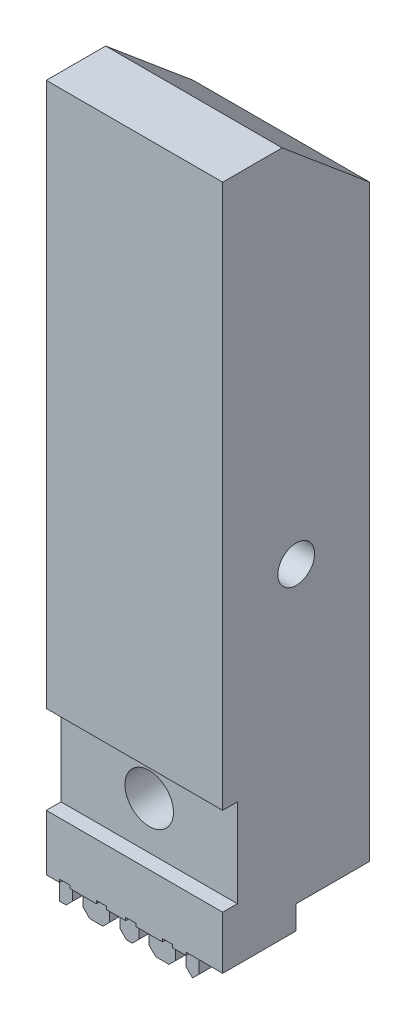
ISO-10303-21;
HEADER;
FILE_DESCRIPTION(('STEP AP214'),'2;1');
FILE_NAME('part.step','',(''),(''),'','','');
FILE_SCHEMA(('AUTOMOTIVE_DESIGN { 1 0 10303 214 1 1 1 1 }'));
ENDSEC;
DATA;
#1=APPLICATION_CONTEXT('core data for automotive mechanical design processes');
#2=APPLICATION_PROTOCOL_DEFINITION('international standard','automotive_design',2000,#1);
#3=PRODUCT_CONTEXT('',#1,'mechanical');
#4=PRODUCT('Part','Part','',(#3));
#5=PRODUCT_RELATED_PRODUCT_CATEGORY('part','',(#4));
#6=PRODUCT_DEFINITION_FORMATION('','',#4);
#7=PRODUCT_DEFINITION_CONTEXT('part definition',#1,'design');
#8=PRODUCT_DEFINITION('design','',#6,#7);
#9=PRODUCT_DEFINITION_SHAPE('','',#8);
#10=(LENGTH_UNIT() NAMED_UNIT(*) SI_UNIT(.MILLI.,.METRE.));
#11=(NAMED_UNIT(*) PLANE_ANGLE_UNIT() SI_UNIT($,.RADIAN.));
#12=(NAMED_UNIT(*) SI_UNIT($,.STERADIAN.) SOLID_ANGLE_UNIT());
#13=UNCERTAINTY_MEASURE_WITH_UNIT(LENGTH_MEASURE(1.E-05),#10,'distance_accuracy_value','');
#14=(GEOMETRIC_REPRESENTATION_CONTEXT(3) GLOBAL_UNCERTAINTY_ASSIGNED_CONTEXT((#13)) GLOBAL_UNIT_ASSIGNED_CONTEXT((#10,
#11,#12)) REPRESENTATION_CONTEXT('',''));
#15=CARTESIAN_POINT('',(0.,0.,0.));
#16=DIRECTION('',(0.,0.,1.));
#17=DIRECTION('',(1.,0.,0.));
#18=AXIS2_PLACEMENT_3D('',#15,#16,#17);
#19=CARTESIAN_POINT('',(0.,-1.13686837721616E-13,10.));
#20=DIRECTION('',(0.,1.,0.));
#21=DIRECTION('',(0.,0.,1.));
#22=AXIS2_PLACEMENT_3D('',#19,#20,#21);
#23=PLANE('',#22);
#24=DIRECTION('',(1.,0.,0.));
#25=VECTOR('',#24,1.);
#26=CARTESIAN_POINT('',(-4.16333634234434E-13,0.,8.29999999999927));
#27=LINE('',#26,#25);
#28=CARTESIAN_POINT('',(-4.16333634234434E-13,0.,8.29999999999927));
#29=VERTEX_POINT('',#28);
#30=CARTESIAN_POINT('',(0.449999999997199,0.,8.29999999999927));
#31=VERTEX_POINT('',#30);
#32=EDGE_CURVE('E558',#29,#31,#27,.T.);
#33=ORIENTED_EDGE('',*,*,#32,.T.);
#34=DIRECTION('',(0.,0.,-1.));
#35=VECTOR('',#34,1.);
#36=CARTESIAN_POINT('',(0.44999999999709,-1.13686837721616E-13,10.));
#37=LINE('',#36,#35);
#38=CARTESIAN_POINT('',(0.449999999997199,0.,9.10000000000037));
#39=VERTEX_POINT('',#38);
#40=EDGE_CURVE('E516',#39,#31,#37,.T.);
#41=ORIENTED_EDGE('',*,*,#40,.F.);
#42=DIRECTION('',(1.,0.,0.));
#43=VECTOR('',#42,1.);
#44=CARTESIAN_POINT('',(-4.16333634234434E-13,0.,9.10000000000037));
#45=LINE('',#44,#43);
#46=CARTESIAN_POINT('',(-4.16333634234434E-13,0.,9.10000000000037));
#47=VERTEX_POINT('',#46);
#48=EDGE_CURVE('E563',#47,#39,#45,.T.);
#49=ORIENTED_EDGE('',*,*,#48,.F.);
#50=DIRECTION('',(0.,0.,-1.));
#51=VECTOR('',#50,1.);
#52=CARTESIAN_POINT('',(0.,-1.13686837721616E-13,10.));
#53=LINE('',#52,#51);
#54=EDGE_CURVE('E423',#47,#29,#53,.T.);
#55=ORIENTED_EDGE('',*,*,#54,.T.);
#56=EDGE_LOOP('',(#33,#41,#49,#55));
#57=FACE_BOUND('',#56,.T.);
#58=ADVANCED_FACE('F33',(#57),#23,.F.);
#59=CARTESIAN_POINT('',(0.44999999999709,-1.13686837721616E-13,10.));
#60=DIRECTION('',(-0.707106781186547,0.707106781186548,0.));
#61=DIRECTION('',(-0.707106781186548,-0.707106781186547,0.));
#62=AXIS2_PLACEMENT_3D('',#59,#60,#61);
#63=PLANE('',#62);
#64=DIRECTION('',(-0.707106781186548,-0.707106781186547,0.));
#65=VECTOR('',#64,1.);
#66=CARTESIAN_POINT('',(0.44999999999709,-1.13686837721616E-13,8.29999999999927));
#67=LINE('',#66,#65);
#68=CARTESIAN_POINT('',(0.899999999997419,0.450000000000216,8.29999999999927));
#69=VERTEX_POINT('',#68);
#70=EDGE_CURVE('E654',#69,#31,#67,.T.);
#71=ORIENTED_EDGE('',*,*,#70,.F.);
#72=DIRECTION('',(0.,0.,-1.));
#73=VECTOR('',#72,1.);
#74=CARTESIAN_POINT('',(0.899999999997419,0.450000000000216,10.));
#75=LINE('',#74,#73);
#76=CARTESIAN_POINT('',(0.899999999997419,0.450000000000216,9.10000000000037));
#77=VERTEX_POINT('',#76);
#78=EDGE_CURVE('E513',#77,#69,#75,.T.);
#79=ORIENTED_EDGE('',*,*,#78,.F.);
#80=DIRECTION('',(0.707106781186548,0.707106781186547,0.));
#81=VECTOR('',#80,1.);
#82=CARTESIAN_POINT('',(0.44999999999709,-1.13686837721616E-13,9.10000000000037));
#83=LINE('',#82,#81);
#84=EDGE_CURVE('E618',#39,#77,#83,.T.);
#85=ORIENTED_EDGE('',*,*,#84,.F.);
#86=ORIENTED_EDGE('',*,*,#40,.T.);
#87=EDGE_LOOP('',(#71,#79,#85,#86));
#88=FACE_BOUND('',#87,.T.);
#89=ADVANCED_FACE('F809',(#88),#63,.F.);
#90=CARTESIAN_POINT('',(0.899999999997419,2.20000000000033,10.));
#91=DIRECTION('',(-1.,0.,0.));
#92=DIRECTION('',(0.,0.,1.));
#93=AXIS2_PLACEMENT_3D('',#90,#91,#92);
#94=PLANE('',#93);
#95=DIRECTION('',(0.,-1.,0.));
#96=VECTOR('',#95,1.);
#97=CARTESIAN_POINT('',(0.899999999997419,2.20000000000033,5.));
#98=LINE('',#97,#96);
#99=CARTESIAN_POINT('',(0.899999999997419,2.20000000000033,5.));
#100=VERTEX_POINT('',#99);
#101=CARTESIAN_POINT('',(0.899999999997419,1.99999999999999,5.));
#102=VERTEX_POINT('',#101);
#103=EDGE_CURVE('E700',#100,#102,#98,.T.);
#104=ORIENTED_EDGE('',*,*,#103,.F.);
#105=DIRECTION('',(0.,0.,-1.));
#106=VECTOR('',#105,1.);
#107=CARTESIAN_POINT('',(0.899999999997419,2.20000000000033,10.));
#108=LINE('',#107,#106);
#109=CARTESIAN_POINT('',(0.899999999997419,2.20000000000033,10.));
#110=VERTEX_POINT('',#109);
#111=EDGE_CURVE('E510',#110,#100,#108,.T.);
#112=ORIENTED_EDGE('',*,*,#111,.F.);
#113=DIRECTION('',(0.,1.,0.));
#114=VECTOR('',#113,1.);
#115=CARTESIAN_POINT('',(0.899999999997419,2.20000000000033,10.));
#116=LINE('',#115,#114);
#117=CARTESIAN_POINT('',(0.899999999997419,1.99999999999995,10.));
#118=VERTEX_POINT('',#117);
#119=EDGE_CURVE('E435',#118,#110,#116,.T.);
#120=ORIENTED_EDGE('',*,*,#119,.F.);
#121=DIRECTION('',(0.,0.,1.));
#122=VECTOR('',#121,1.);
#123=CARTESIAN_POINT('',(0.899999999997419,1.99999999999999,10.));
#124=LINE('',#123,#122);
#125=CARTESIAN_POINT('',(0.899999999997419,1.99999999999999,9.10000000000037));
#126=VERTEX_POINT('',#125);
#127=EDGE_CURVE('E399',#126,#118,#124,.T.);
#128=ORIENTED_EDGE('',*,*,#127,.F.);
#129=DIRECTION('',(0.,1.,0.));
#130=VECTOR('',#129,1.);
#131=CARTESIAN_POINT('',(0.899999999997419,2.20000000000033,9.10000000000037));
#132=LINE('',#131,#130);
#133=EDGE_CURVE('E616',#77,#126,#132,.T.);
#134=ORIENTED_EDGE('',*,*,#133,.F.);
#135=ORIENTED_EDGE('',*,*,#78,.T.);
#136=DIRECTION('',(0.,-1.,0.));
#137=VECTOR('',#136,1.);
#138=CARTESIAN_POINT('',(0.899999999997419,2.20000000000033,8.29999999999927));
#139=LINE('',#138,#137);
#140=CARTESIAN_POINT('',(0.899999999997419,1.99999999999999,8.29999999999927));
#141=VERTEX_POINT('',#140);
#142=EDGE_CURVE('E652',#141,#69,#139,.T.);
#143=ORIENTED_EDGE('',*,*,#142,.F.);
#144=DIRECTION('',(0.,0.,1.));
#145=VECTOR('',#144,1.);
#146=CARTESIAN_POINT('',(0.899999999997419,1.99999999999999,10.));
#147=LINE('',#146,#145);
#148=EDGE_CURVE('E672',#102,#141,#147,.T.);
#149=ORIENTED_EDGE('',*,*,#148,.F.);
#150=EDGE_LOOP('',(#104,#112,#120,#128,#134,#135,#143,#149));
#151=FACE_BOUND('',#150,.T.);
#152=ADVANCED_FACE('F814',(#151),#94,.F.);
#153=CARTESIAN_POINT('',(0.899999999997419,2.20000000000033,10.));
#154=DIRECTION('',(7.31681580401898E-13,1.,0.));
#155=DIRECTION('',(-1.,7.31681580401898E-13,0.));
#156=AXIS2_PLACEMENT_3D('',#153,#154,#155);
#157=PLANE('',#156);
#158=DIRECTION('',(-1.,7.31681580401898E-13,0.));
#159=VECTOR('',#158,1.);
#160=CARTESIAN_POINT('',(0.899999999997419,2.20000000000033,5.));
#161=LINE('',#160,#159);
#162=CARTESIAN_POINT('',(1.59999999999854,2.19999999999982,5.));
#163=VERTEX_POINT('',#162);
#164=EDGE_CURVE('E698',#163,#100,#161,.T.);
#165=ORIENTED_EDGE('',*,*,#164,.F.);
#166=DIRECTION('',(0.,0.,-1.));
#167=VECTOR('',#166,1.);
#168=CARTESIAN_POINT('',(1.59999999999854,2.19999999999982,10.));
#169=LINE('',#168,#167);
#170=CARTESIAN_POINT('',(1.59999999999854,2.19999999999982,10.));
#171=VERTEX_POINT('',#170);
#172=EDGE_CURVE('E507',#171,#163,#169,.T.);
#173=ORIENTED_EDGE('',*,*,#172,.F.);
#174=DIRECTION('',(1.,-7.31681580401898E-13,0.));
#175=VECTOR('',#174,1.);
#176=CARTESIAN_POINT('',(0.899999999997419,2.20000000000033,10.));
#177=LINE('',#176,#175);
#178=EDGE_CURVE('E705',#110,#171,#177,.T.);
#179=ORIENTED_EDGE('',*,*,#178,.F.);
#180=ORIENTED_EDGE('',*,*,#111,.T.);
#181=EDGE_LOOP('',(#165,#173,#179,#180));
#182=FACE_BOUND('',#181,.T.);
#183=ADVANCED_FACE('F837',(#182),#157,.F.);
#184=CARTESIAN_POINT('',(1.59999999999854,2.19999999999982,10.));
#185=DIRECTION('',(1.,0.,0.));
#186=DIRECTION('',(0.,0.,-1.));
#187=AXIS2_PLACEMENT_3D('',#184,#185,#186);
#188=PLANE('',#187);
#189=DIRECTION('',(0.,1.,0.));
#190=VECTOR('',#189,1.);
#191=CARTESIAN_POINT('',(1.59999999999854,2.19999999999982,5.));
#192=LINE('',#191,#190);
#193=CARTESIAN_POINT('',(1.59999999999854,1.99999999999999,5.));
#194=VERTEX_POINT('',#193);
#195=EDGE_CURVE('E696',#194,#163,#192,.T.);
#196=ORIENTED_EDGE('',*,*,#195,.F.);
#197=DIRECTION('',(0.,0.,-1.));
#198=VECTOR('',#197,1.);
#199=CARTESIAN_POINT('',(1.59999999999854,1.99999999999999,10.));
#200=LINE('',#199,#198);
#201=CARTESIAN_POINT('',(1.59999999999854,1.99999999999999,8.29999999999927));
#202=VERTEX_POINT('',#201);
#203=EDGE_CURVE('E670',#202,#194,#200,.T.);
#204=ORIENTED_EDGE('',*,*,#203,.F.);
#205=DIRECTION('',(0.,1.,0.));
#206=VECTOR('',#205,1.);
#207=CARTESIAN_POINT('',(1.59999999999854,2.19999999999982,8.29999999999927));
#208=LINE('',#207,#206);
#209=CARTESIAN_POINT('',(1.59999999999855,0.449999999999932,8.29999999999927));
#210=VERTEX_POINT('',#209);
#211=EDGE_CURVE('E650',#210,#202,#208,.T.);
#212=ORIENTED_EDGE('',*,*,#211,.F.);
#213=DIRECTION('',(0.,0.,-1.));
#214=VECTOR('',#213,1.);
#215=CARTESIAN_POINT('',(1.59999999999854,0.449999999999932,10.));
#216=LINE('',#215,#214);
#217=CARTESIAN_POINT('',(1.59999999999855,0.449999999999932,9.10000000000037));
#218=VERTEX_POINT('',#217);
#219=EDGE_CURVE('E504',#218,#210,#216,.T.);
#220=ORIENTED_EDGE('',*,*,#219,.F.);
#221=DIRECTION('',(0.,-1.,0.));
#222=VECTOR('',#221,1.);
#223=CARTESIAN_POINT('',(1.59999999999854,2.19999999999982,9.10000000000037));
#224=LINE('',#223,#222);
#225=CARTESIAN_POINT('',(1.59999999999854,1.99999999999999,9.10000000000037));
#226=VERTEX_POINT('',#225);
#227=EDGE_CURVE('E614',#226,#218,#224,.T.);
#228=ORIENTED_EDGE('',*,*,#227,.F.);
#229=DIRECTION('',(0.,0.,-1.));
#230=VECTOR('',#229,1.);
#231=CARTESIAN_POINT('',(1.59999999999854,1.99999999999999,10.));
#232=LINE('',#231,#230);
#233=CARTESIAN_POINT('',(1.59999999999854,1.99999999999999,10.));
#234=VERTEX_POINT('',#233);
#235=EDGE_CURVE('E581',#234,#226,#232,.T.);
#236=ORIENTED_EDGE('',*,*,#235,.F.);
#237=DIRECTION('',(0.,-1.,0.));
#238=VECTOR('',#237,1.);
#239=CARTESIAN_POINT('',(1.59999999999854,2.19999999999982,10.));
#240=LINE('',#239,#238);
#241=EDGE_CURVE('E707',#171,#234,#240,.T.);
#242=ORIENTED_EDGE('',*,*,#241,.F.);
#243=ORIENTED_EDGE('',*,*,#172,.T.);
#244=EDGE_LOOP('',(#196,#204,#212,#220,#228,#236,#242,#243));
#245=FACE_BOUND('',#244,.T.);
#246=ADVANCED_FACE('F841',(#245),#188,.F.);
#247=CARTESIAN_POINT('',(2.04999999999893,-4.54729625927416E-13,10.));
#248=DIRECTION('',(0.707106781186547,0.707106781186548,0.));
#249=DIRECTION('',(-0.707106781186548,0.707106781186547,0.));
#250=AXIS2_PLACEMENT_3D('',#247,#248,#249);
#251=PLANE('',#250);
#252=DIRECTION('',(-0.707106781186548,0.707106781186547,0.));
#253=VECTOR('',#252,1.);
#254=CARTESIAN_POINT('',(2.04999999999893,-4.54729625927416E-13,8.29999999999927));
#255=LINE('',#254,#253);
#256=CARTESIAN_POINT('',(2.04999999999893,0.,8.29999999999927));
#257=VERTEX_POINT('',#256);
#258=EDGE_CURVE('E648',#257,#210,#255,.T.);
#259=ORIENTED_EDGE('',*,*,#258,.F.);
#260=DIRECTION('',(0.,0.,-1.));
#261=VECTOR('',#260,1.);
#262=CARTESIAN_POINT('',(2.04999999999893,-4.54729625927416E-13,10.));
#263=LINE('',#262,#261);
#264=CARTESIAN_POINT('',(2.04999999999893,0.,9.10000000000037));
#265=VERTEX_POINT('',#264);
#266=EDGE_CURVE('E501',#265,#257,#263,.T.);
#267=ORIENTED_EDGE('',*,*,#266,.F.);
#268=DIRECTION('',(0.707106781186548,-0.707106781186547,0.));
#269=VECTOR('',#268,1.);
#270=CARTESIAN_POINT('',(2.04999999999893,-4.54729625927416E-13,9.10000000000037));
#271=LINE('',#270,#269);
#272=EDGE_CURVE('E612',#218,#265,#271,.T.);
#273=ORIENTED_EDGE('',*,*,#272,.F.);
#274=ORIENTED_EDGE('',*,*,#219,.T.);
#275=EDGE_LOOP('',(#259,#267,#273,#274));
#276=FACE_BOUND('',#275,.T.);
#277=ADVANCED_FACE('F1124',(#276),#251,.F.);
#278=CARTESIAN_POINT('',(2.04999999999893,-4.54729625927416E-13,10.));
#279=DIRECTION('',(0.,1.,0.));
#280=DIRECTION('',(0.,0.,1.));
#281=AXIS2_PLACEMENT_3D('',#278,#279,#280);
#282=PLANE('',#281);
#283=CARTESIAN_POINT('',(2.94999999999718,0.,8.29999999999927));
#284=VERTEX_POINT('',#283);
#285=EDGE_CURVE('E561',#257,#284,#27,.T.);
#286=ORIENTED_EDGE('',*,*,#285,.T.);
#287=DIRECTION('',(0.,0.,-1.));
#288=VECTOR('',#287,1.);
#289=CARTESIAN_POINT('',(2.94999999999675,-4.54729625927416E-13,10.));
#290=LINE('',#289,#288);
#291=CARTESIAN_POINT('',(2.94999999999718,0.,9.10000000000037));
#292=VERTEX_POINT('',#291);
#293=EDGE_CURVE('E498',#292,#284,#290,.T.);
#294=ORIENTED_EDGE('',*,*,#293,.F.);
#295=EDGE_CURVE('E565',#265,#292,#45,.T.);
#296=ORIENTED_EDGE('',*,*,#295,.F.);
#297=ORIENTED_EDGE('',*,*,#266,.T.);
#298=EDGE_LOOP('',(#286,#294,#296,#297));
#299=FACE_BOUND('',#298,.T.);
#300=ADVANCED_FACE('F930',(#299),#282,.F.);
#301=CARTESIAN_POINT('',(2.94999999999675,-4.54729625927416E-13,10.));
#302=DIRECTION('',(-0.707106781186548,0.707106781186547,0.));
#303=DIRECTION('',(-0.707106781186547,-0.707106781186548,0.));
#304=AXIS2_PLACEMENT_3D('',#301,#302,#303);
#305=PLANE('',#304);
#306=DIRECTION('',(-0.707106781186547,-0.707106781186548,0.));
#307=VECTOR('',#306,1.);
#308=CARTESIAN_POINT('',(2.94999999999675,-4.54729625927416E-13,8.29999999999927));
#309=LINE('',#308,#307);
#310=CARTESIAN_POINT('',(3.39999999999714,0.449999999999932,8.29999999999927));
#311=VERTEX_POINT('',#310);
#312=EDGE_CURVE('E646',#311,#284,#309,.T.);
#313=ORIENTED_EDGE('',*,*,#312,.F.);
#314=DIRECTION('',(0.,0.,-1.));
#315=VECTOR('',#314,1.);
#316=CARTESIAN_POINT('',(3.39999999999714,0.449999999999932,10.));
#317=LINE('',#316,#315);
#318=CARTESIAN_POINT('',(3.39999999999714,0.449999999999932,9.10000000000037));
#319=VERTEX_POINT('',#318);
#320=EDGE_CURVE('E495',#319,#311,#317,.T.);
#321=ORIENTED_EDGE('',*,*,#320,.F.);
#322=DIRECTION('',(0.707106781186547,0.707106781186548,0.));
#323=VECTOR('',#322,1.);
#324=CARTESIAN_POINT('',(2.94999999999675,-4.54729625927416E-13,9.10000000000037));
#325=LINE('',#324,#323);
#326=EDGE_CURVE('E610',#292,#319,#325,.T.);
#327=ORIENTED_EDGE('',*,*,#326,.F.);
#328=ORIENTED_EDGE('',*,*,#293,.T.);
#329=EDGE_LOOP('',(#313,#321,#327,#328));
#330=FACE_BOUND('',#329,.T.);
#331=ADVANCED_FACE('F925',(#330),#305,.F.);
#332=CARTESIAN_POINT('',(3.39999999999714,2.19999999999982,10.));
#333=DIRECTION('',(-1.,0.,0.));
#334=DIRECTION('',(0.,0.,1.));
#335=AXIS2_PLACEMENT_3D('',#332,#333,#334);
#336=PLANE('',#335);
#337=DIRECTION('',(0.,-1.,0.));
#338=VECTOR('',#337,1.);
#339=CARTESIAN_POINT('',(3.39999999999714,2.19999999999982,5.));
#340=LINE('',#339,#338);
#341=CARTESIAN_POINT('',(3.39999999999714,2.19999999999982,5.));
#342=VERTEX_POINT('',#341);
#343=CARTESIAN_POINT('',(3.39999999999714,1.99999999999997,5.));
#344=VERTEX_POINT('',#343);
#345=EDGE_CURVE('E694',#342,#344,#340,.T.);
#346=ORIENTED_EDGE('',*,*,#345,.F.);
#347=DIRECTION('',(0.,0.,-1.));
#348=VECTOR('',#347,1.);
#349=CARTESIAN_POINT('',(3.39999999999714,2.19999999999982,10.));
#350=LINE('',#349,#348);
#351=CARTESIAN_POINT('',(3.39999999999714,2.19999999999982,10.));
#352=VERTEX_POINT('',#351);
#353=EDGE_CURVE('E492',#352,#342,#350,.T.);
#354=ORIENTED_EDGE('',*,*,#353,.F.);
#355=DIRECTION('',(0.,1.,0.));
#356=VECTOR('',#355,1.);
#357=CARTESIAN_POINT('',(3.39999999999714,2.19999999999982,10.));
#358=LINE('',#357,#356);
#359=CARTESIAN_POINT('',(3.39999999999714,1.99999999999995,10.));
#360=VERTEX_POINT('',#359);
#361=EDGE_CURVE('E710',#360,#352,#358,.T.);
#362=ORIENTED_EDGE('',*,*,#361,.F.);
#363=DIRECTION('',(0.,0.,1.));
#364=VECTOR('',#363,1.);
#365=CARTESIAN_POINT('',(3.39999999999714,1.99999999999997,10.));
#366=LINE('',#365,#364);
#367=CARTESIAN_POINT('',(3.39999999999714,1.99999999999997,9.10000000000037));
#368=VERTEX_POINT('',#367);
#369=EDGE_CURVE('E579',#368,#360,#366,.T.);
#370=ORIENTED_EDGE('',*,*,#369,.F.);
#371=DIRECTION('',(0.,1.,0.));
#372=VECTOR('',#371,1.);
#373=CARTESIAN_POINT('',(3.39999999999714,2.19999999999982,9.10000000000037));
#374=LINE('',#373,#372);
#375=EDGE_CURVE('E608',#319,#368,#374,.T.);
#376=ORIENTED_EDGE('',*,*,#375,.F.);
#377=ORIENTED_EDGE('',*,*,#320,.T.);
#378=DIRECTION('',(0.,-1.,0.));
#379=VECTOR('',#378,1.);
#380=CARTESIAN_POINT('',(3.39999999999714,2.19999999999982,8.29999999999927));
#381=LINE('',#380,#379);
#382=CARTESIAN_POINT('',(3.39999999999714,1.99999999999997,8.29999999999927));
#383=VERTEX_POINT('',#382);
#384=EDGE_CURVE('E644',#383,#311,#381,.T.);
#385=ORIENTED_EDGE('',*,*,#384,.F.);
#386=DIRECTION('',(0.,0.,1.));
#387=VECTOR('',#386,1.);
#388=CARTESIAN_POINT('',(3.39999999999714,1.99999999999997,10.));
#389=LINE('',#388,#387);
#390=EDGE_CURVE('E668',#344,#383,#389,.T.);
#391=ORIENTED_EDGE('',*,*,#390,.F.);
#392=EDGE_LOOP('',(#346,#354,#362,#370,#376,#377,#385,#391));
#393=FACE_BOUND('',#392,.T.);
#394=ADVANCED_FACE('F921',(#393),#336,.F.);
#395=CARTESIAN_POINT('',(3.39999999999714,2.19999999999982,10.));
#396=DIRECTION('',(0.,1.,0.));
#397=DIRECTION('',(0.,0.,1.));
#398=AXIS2_PLACEMENT_3D('',#395,#396,#397);
#399=PLANE('',#398);
#400=DIRECTION('',(-1.,0.,0.));
#401=VECTOR('',#400,1.);
#402=CARTESIAN_POINT('',(3.39999999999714,2.19999999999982,5.));
#403=LINE('',#402,#401);
#404=CARTESIAN_POINT('',(4.09999999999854,2.19999999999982,5.));
#405=VERTEX_POINT('',#404);
#406=EDGE_CURVE('E692',#405,#342,#403,.T.);
#407=ORIENTED_EDGE('',*,*,#406,.F.);
#408=DIRECTION('',(0.,0.,-1.));
#409=VECTOR('',#408,1.);
#410=CARTESIAN_POINT('',(4.09999999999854,2.19999999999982,10.));
#411=LINE('',#410,#409);
#412=CARTESIAN_POINT('',(4.09999999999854,2.19999999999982,10.));
#413=VERTEX_POINT('',#412);
#414=EDGE_CURVE('E489',#413,#405,#411,.T.);
#415=ORIENTED_EDGE('',*,*,#414,.F.);
#416=DIRECTION('',(1.,0.,0.));
#417=VECTOR('',#416,1.);
#418=CARTESIAN_POINT('',(3.39999999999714,2.19999999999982,10.));
#419=LINE('',#418,#417);
#420=EDGE_CURVE('E712',#352,#413,#419,.T.);
#421=ORIENTED_EDGE('',*,*,#420,.F.);
#422=ORIENTED_EDGE('',*,*,#353,.T.);
#423=EDGE_LOOP('',(#407,#415,#421,#422));
#424=FACE_BOUND('',#423,.T.);
#425=ADVANCED_FACE('F978',(#424),#399,.F.);
#426=CARTESIAN_POINT('',(4.09999999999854,2.19999999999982,10.));
#427=DIRECTION('',(1.,0.,0.));
#428=DIRECTION('',(0.,0.,-1.));
#429=AXIS2_PLACEMENT_3D('',#426,#427,#428);
#430=PLANE('',#429);
#431=DIRECTION('',(0.,1.,0.));
#432=VECTOR('',#431,1.);
#433=CARTESIAN_POINT('',(4.09999999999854,2.19999999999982,5.));
#434=LINE('',#433,#432);
#435=CARTESIAN_POINT('',(4.09999999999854,1.99999999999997,5.));
#436=VERTEX_POINT('',#435);
#437=EDGE_CURVE('E690',#436,#405,#434,.T.);
#438=ORIENTED_EDGE('',*,*,#437,.F.);
#439=DIRECTION('',(0.,0.,-1.));
#440=VECTOR('',#439,1.);
#441=CARTESIAN_POINT('',(4.09999999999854,1.99999999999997,10.));
#442=LINE('',#441,#440);
#443=CARTESIAN_POINT('',(4.09999999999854,1.99999999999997,8.29999999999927));
#444=VERTEX_POINT('',#443);
#445=EDGE_CURVE('E666',#444,#436,#442,.T.);
#446=ORIENTED_EDGE('',*,*,#445,.F.);
#447=DIRECTION('',(0.,1.,0.));
#448=VECTOR('',#447,1.);
#449=CARTESIAN_POINT('',(4.09999999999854,2.19999999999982,8.29999999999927));
#450=LINE('',#449,#448);
#451=CARTESIAN_POINT('',(4.09999999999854,0.449999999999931,8.29999999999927));
#452=VERTEX_POINT('',#451);
#453=EDGE_CURVE('E642',#452,#444,#450,.T.);
#454=ORIENTED_EDGE('',*,*,#453,.F.);
#455=DIRECTION('',(0.,0.,-1.));
#456=VECTOR('',#455,1.);
#457=CARTESIAN_POINT('',(4.09999999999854,0.449999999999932,10.));
#458=LINE('',#457,#456);
#459=CARTESIAN_POINT('',(4.09999999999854,0.449999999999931,9.10000000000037));
#460=VERTEX_POINT('',#459);
#461=EDGE_CURVE('E486',#460,#452,#458,.T.);
#462=ORIENTED_EDGE('',*,*,#461,.F.);
#463=DIRECTION('',(0.,-1.,0.));
#464=VECTOR('',#463,1.);
#465=CARTESIAN_POINT('',(4.09999999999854,2.19999999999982,9.10000000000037));
#466=LINE('',#465,#464);
#467=CARTESIAN_POINT('',(4.09999999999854,1.99999999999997,9.10000000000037));
#468=VERTEX_POINT('',#467);
#469=EDGE_CURVE('E606',#468,#460,#466,.T.);
#470=ORIENTED_EDGE('',*,*,#469,.F.);
#471=DIRECTION('',(0.,0.,-1.));
#472=VECTOR('',#471,1.);
#473=CARTESIAN_POINT('',(4.09999999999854,1.99999999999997,10.));
#474=LINE('',#473,#472);
#475=CARTESIAN_POINT('',(4.09999999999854,1.99999999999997,10.));
#476=VERTEX_POINT('',#475);
#477=EDGE_CURVE('E577',#476,#468,#474,.T.);
#478=ORIENTED_EDGE('',*,*,#477,.F.);
#479=DIRECTION('',(0.,-1.,0.));
#480=VECTOR('',#479,1.);
#481=CARTESIAN_POINT('',(4.09999999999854,2.19999999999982,10.));
#482=LINE('',#481,#480);
#483=EDGE_CURVE('E714',#413,#476,#482,.T.);
#484=ORIENTED_EDGE('',*,*,#483,.F.);
#485=ORIENTED_EDGE('',*,*,#414,.T.);
#486=EDGE_LOOP('',(#438,#446,#454,#462,#470,#478,#484,#485));
#487=FACE_BOUND('',#486,.T.);
#488=ADVANCED_FACE('F970',(#487),#430,.F.);
#489=CARTESIAN_POINT('',(4.54999999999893,-4.54729625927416E-13,10.));
#490=DIRECTION('',(0.707106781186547,0.707106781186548,0.));
#491=DIRECTION('',(-0.707106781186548,0.707106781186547,0.));
#492=AXIS2_PLACEMENT_3D('',#489,#490,#491);
#493=PLANE('',#492);
#494=DIRECTION('',(-0.707106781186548,0.707106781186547,0.));
#495=VECTOR('',#494,1.);
#496=CARTESIAN_POINT('',(4.54999999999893,-4.54729625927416E-13,8.29999999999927));
#497=LINE('',#496,#495);
#498=CARTESIAN_POINT('',(4.54999999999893,0.,8.29999999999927));
#499=VERTEX_POINT('',#498);
#500=EDGE_CURVE('E640',#499,#452,#497,.T.);
#501=ORIENTED_EDGE('',*,*,#500,.F.);
#502=DIRECTION('',(0.,0.,-1.));
#503=VECTOR('',#502,1.);
#504=CARTESIAN_POINT('',(4.54999999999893,-4.54729625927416E-13,10.));
#505=LINE('',#504,#503);
#506=CARTESIAN_POINT('',(4.54999999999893,0.,9.10000000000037));
#507=VERTEX_POINT('',#506);
#508=EDGE_CURVE('E483',#507,#499,#505,.T.);
#509=ORIENTED_EDGE('',*,*,#508,.F.);
#510=DIRECTION('',(0.707106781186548,-0.707106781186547,0.));
#511=VECTOR('',#510,1.);
#512=CARTESIAN_POINT('',(4.54999999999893,-4.54729625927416E-13,9.10000000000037));
#513=LINE('',#512,#511);
#514=EDGE_CURVE('E604',#460,#507,#513,.T.);
#515=ORIENTED_EDGE('',*,*,#514,.F.);
#516=ORIENTED_EDGE('',*,*,#461,.T.);
#517=EDGE_LOOP('',(#501,#509,#515,#516));
#518=FACE_BOUND('',#517,.T.);
#519=ADVANCED_FACE('F1110',(#518),#493,.F.);
#520=CARTESIAN_POINT('',(4.54999999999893,-4.54729625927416E-13,10.));
#521=DIRECTION('',(0.,1.,0.));
#522=DIRECTION('',(0.,0.,1.));
#523=AXIS2_PLACEMENT_3D('',#520,#521,#522);
#524=PLANE('',#523);
#525=CARTESIAN_POINT('',(4.94999999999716,0.,8.29999999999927));
#526=VERTEX_POINT('',#525);
#527=EDGE_CURVE('E933',#499,#526,#27,.T.);
#528=ORIENTED_EDGE('',*,*,#527,.T.);
#529=DIRECTION('',(0.,0.,-1.));
#530=VECTOR('',#529,1.);
#531=CARTESIAN_POINT('',(4.94999999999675,-4.54729625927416E-13,10.));
#532=LINE('',#531,#530);
#533=CARTESIAN_POINT('',(4.94999999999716,0.,9.10000000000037));
#534=VERTEX_POINT('',#533);
#535=EDGE_CURVE('E480',#534,#526,#532,.T.);
#536=ORIENTED_EDGE('',*,*,#535,.F.);
#537=EDGE_CURVE('E1451',#507,#534,#45,.T.);
#538=ORIENTED_EDGE('',*,*,#537,.F.);
#539=ORIENTED_EDGE('',*,*,#508,.T.);
#540=EDGE_LOOP('',(#528,#536,#538,#539));
#541=FACE_BOUND('',#540,.T.);
#542=ADVANCED_FACE('F1106',(#541),#524,.F.);
#543=CARTESIAN_POINT('',(4.94999999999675,-4.54729625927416E-13,10.));
#544=DIRECTION('',(-0.707106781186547,0.707106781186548,0.));
#545=DIRECTION('',(-0.707106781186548,-0.707106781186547,0.));
#546=AXIS2_PLACEMENT_3D('',#543,#544,#545);
#547=PLANE('',#546);
#548=DIRECTION('',(-0.707106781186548,-0.707106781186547,0.));
#549=VECTOR('',#548,1.);
#550=CARTESIAN_POINT('',(4.94999999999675,-4.54729625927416E-13,8.29999999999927));
#551=LINE('',#550,#549);
#552=CARTESIAN_POINT('',(5.39999999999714,0.449999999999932,8.29999999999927));
#553=VERTEX_POINT('',#552);
#554=EDGE_CURVE('E638',#553,#526,#551,.T.);
#555=ORIENTED_EDGE('',*,*,#554,.F.);
#556=DIRECTION('',(0.,0.,-1.));
#557=VECTOR('',#556,1.);
#558=CARTESIAN_POINT('',(5.39999999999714,0.449999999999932,10.));
#559=LINE('',#558,#557);
#560=CARTESIAN_POINT('',(5.39999999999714,0.449999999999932,9.10000000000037));
#561=VERTEX_POINT('',#560);
#562=EDGE_CURVE('E477',#561,#553,#559,.T.);
#563=ORIENTED_EDGE('',*,*,#562,.F.);
#564=DIRECTION('',(0.707106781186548,0.707106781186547,0.));
#565=VECTOR('',#564,1.);
#566=CARTESIAN_POINT('',(4.94999999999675,-4.54729625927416E-13,9.10000000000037));
#567=LINE('',#566,#565);
#568=EDGE_CURVE('E602',#534,#561,#567,.T.);
#569=ORIENTED_EDGE('',*,*,#568,.F.);
#570=ORIENTED_EDGE('',*,*,#535,.T.);
#571=EDGE_LOOP('',(#555,#563,#569,#570));
#572=FACE_BOUND('',#571,.T.);
#573=ADVANCED_FACE('F1103',(#572),#547,.F.);
#574=CARTESIAN_POINT('',(5.39999999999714,2.19999999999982,10.));
#575=DIRECTION('',(-1.,0.,0.));
#576=DIRECTION('',(0.,0.,1.));
#577=AXIS2_PLACEMENT_3D('',#574,#575,#576);
#578=PLANE('',#577);
#579=DIRECTION('',(0.,-1.,0.));
#580=VECTOR('',#579,1.);
#581=CARTESIAN_POINT('',(5.39999999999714,2.19999999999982,5.));
#582=LINE('',#581,#580);
#583=CARTESIAN_POINT('',(5.39999999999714,2.19999999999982,5.));
#584=VERTEX_POINT('',#583);
#585=CARTESIAN_POINT('',(5.39999999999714,1.99999999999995,5.));
#586=VERTEX_POINT('',#585);
#587=EDGE_CURVE('E688',#584,#586,#582,.T.);
#588=ORIENTED_EDGE('',*,*,#587,.F.);
#589=DIRECTION('',(0.,0.,-1.));
#590=VECTOR('',#589,1.);
#591=CARTESIAN_POINT('',(5.39999999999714,2.19999999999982,10.));
#592=LINE('',#591,#590);
#593=CARTESIAN_POINT('',(5.39999999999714,2.19999999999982,10.));
#594=VERTEX_POINT('',#593);
#595=EDGE_CURVE('E474',#594,#584,#592,.T.);
#596=ORIENTED_EDGE('',*,*,#595,.F.);
#597=DIRECTION('',(0.,1.,0.));
#598=VECTOR('',#597,1.);
#599=CARTESIAN_POINT('',(5.39999999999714,2.19999999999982,10.));
#600=LINE('',#599,#598);
#601=CARTESIAN_POINT('',(5.39999999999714,1.99999999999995,10.));
#602=VERTEX_POINT('',#601);
#603=EDGE_CURVE('E717',#602,#594,#600,.T.);
#604=ORIENTED_EDGE('',*,*,#603,.F.);
#605=DIRECTION('',(0.,0.,1.));
#606=VECTOR('',#605,1.);
#607=CARTESIAN_POINT('',(5.39999999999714,1.99999999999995,10.));
#608=LINE('',#607,#606);
#609=CARTESIAN_POINT('',(5.39999999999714,1.99999999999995,9.10000000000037));
#610=VERTEX_POINT('',#609);
#611=EDGE_CURVE('E575',#610,#602,#608,.T.);
#612=ORIENTED_EDGE('',*,*,#611,.F.);
#613=DIRECTION('',(0.,1.,0.));
#614=VECTOR('',#613,1.);
#615=CARTESIAN_POINT('',(5.39999999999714,2.19999999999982,9.10000000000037));
#616=LINE('',#615,#614);
#617=EDGE_CURVE('E600',#561,#610,#616,.T.);
#618=ORIENTED_EDGE('',*,*,#617,.F.);
#619=ORIENTED_EDGE('',*,*,#562,.T.);
#620=DIRECTION('',(0.,-1.,0.));
#621=VECTOR('',#620,1.);
#622=CARTESIAN_POINT('',(5.39999999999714,2.19999999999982,8.29999999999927));
#623=LINE('',#622,#621);
#624=CARTESIAN_POINT('',(5.39999999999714,1.99999999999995,8.29999999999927));
#625=VERTEX_POINT('',#624);
#626=EDGE_CURVE('E636',#625,#553,#623,.T.);
#627=ORIENTED_EDGE('',*,*,#626,.F.);
#628=DIRECTION('',(0.,0.,1.));
#629=VECTOR('',#628,1.);
#630=CARTESIAN_POINT('',(5.39999999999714,1.99999999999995,10.));
#631=LINE('',#630,#629);
#632=EDGE_CURVE('E664',#586,#625,#631,.T.);
#633=ORIENTED_EDGE('',*,*,#632,.F.);
#634=EDGE_LOOP('',(#588,#596,#604,#612,#618,#619,#627,#633));
#635=FACE_BOUND('',#634,.T.);
#636=ADVANCED_FACE('F1017',(#635),#578,.F.);
#637=CARTESIAN_POINT('',(5.39999999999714,2.19999999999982,10.));
#638=DIRECTION('',(0.,1.,0.));
#639=DIRECTION('',(0.,0.,1.));
#640=AXIS2_PLACEMENT_3D('',#637,#638,#639);
#641=PLANE('',#640);
#642=DIRECTION('',(-1.,0.,0.));
#643=VECTOR('',#642,1.);
#644=CARTESIAN_POINT('',(5.39999999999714,2.19999999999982,5.));
#645=LINE('',#644,#643);
#646=CARTESIAN_POINT('',(6.09999999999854,2.19999999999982,5.));
#647=VERTEX_POINT('',#646);
#648=EDGE_CURVE('E686',#647,#584,#645,.T.);
#649=ORIENTED_EDGE('',*,*,#648,.F.);
#650=DIRECTION('',(0.,0.,-1.));
#651=VECTOR('',#650,1.);
#652=CARTESIAN_POINT('',(6.09999999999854,2.19999999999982,10.));
#653=LINE('',#652,#651);
#654=CARTESIAN_POINT('',(6.09999999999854,2.19999999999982,10.));
#655=VERTEX_POINT('',#654);
#656=EDGE_CURVE('E471',#655,#647,#653,.T.);
#657=ORIENTED_EDGE('',*,*,#656,.F.);
#658=DIRECTION('',(1.,0.,0.));
#659=VECTOR('',#658,1.);
#660=CARTESIAN_POINT('',(5.39999999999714,2.19999999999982,10.));
#661=LINE('',#660,#659);
#662=EDGE_CURVE('E719',#594,#655,#661,.T.);
#663=ORIENTED_EDGE('',*,*,#662,.F.);
#664=ORIENTED_EDGE('',*,*,#595,.T.);
#665=EDGE_LOOP('',(#649,#657,#663,#664));
#666=FACE_BOUND('',#665,.T.);
#667=ADVANCED_FACE('F1013',(#666),#641,.F.);
#668=CARTESIAN_POINT('',(6.09999999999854,2.19999999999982,10.));
#669=DIRECTION('',(1.,0.,0.));
#670=DIRECTION('',(0.,0.,-1.));
#671=AXIS2_PLACEMENT_3D('',#668,#669,#670);
#672=PLANE('',#671);
#673=DIRECTION('',(0.,1.,0.));
#674=VECTOR('',#673,1.);
#675=CARTESIAN_POINT('',(6.09999999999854,2.19999999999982,5.));
#676=LINE('',#675,#674);
#677=CARTESIAN_POINT('',(6.09999999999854,1.99999999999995,5.));
#678=VERTEX_POINT('',#677);
#679=EDGE_CURVE('E684',#678,#647,#676,.T.);
#680=ORIENTED_EDGE('',*,*,#679,.F.);
#681=DIRECTION('',(0.,0.,-1.));
#682=VECTOR('',#681,1.);
#683=CARTESIAN_POINT('',(6.09999999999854,1.99999999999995,10.));
#684=LINE('',#683,#682);
#685=CARTESIAN_POINT('',(6.09999999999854,1.99999999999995,8.29999999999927));
#686=VERTEX_POINT('',#685);
#687=EDGE_CURVE('E662',#686,#678,#684,.T.);
#688=ORIENTED_EDGE('',*,*,#687,.F.);
#689=DIRECTION('',(0.,1.,0.));
#690=VECTOR('',#689,1.);
#691=CARTESIAN_POINT('',(6.09999999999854,2.19999999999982,8.29999999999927));
#692=LINE('',#691,#690);
#693=CARTESIAN_POINT('',(6.09999999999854,0.449999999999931,8.29999999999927));
#694=VERTEX_POINT('',#693);
#695=EDGE_CURVE('E634',#694,#686,#692,.T.);
#696=ORIENTED_EDGE('',*,*,#695,.F.);
#697=DIRECTION('',(0.,0.,-1.));
#698=VECTOR('',#697,1.);
#699=CARTESIAN_POINT('',(6.09999999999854,0.449999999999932,10.));
#700=LINE('',#699,#698);
#701=CARTESIAN_POINT('',(6.09999999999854,0.449999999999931,9.10000000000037));
#702=VERTEX_POINT('',#701);
#703=EDGE_CURVE('E468',#702,#694,#700,.T.);
#704=ORIENTED_EDGE('',*,*,#703,.F.);
#705=DIRECTION('',(0.,-1.,0.));
#706=VECTOR('',#705,1.);
#707=CARTESIAN_POINT('',(6.09999999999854,2.19999999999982,9.10000000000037));
#708=LINE('',#707,#706);
#709=CARTESIAN_POINT('',(6.09999999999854,1.99999999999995,9.10000000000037));
#710=VERTEX_POINT('',#709);
#711=EDGE_CURVE('E598',#710,#702,#708,.T.);
#712=ORIENTED_EDGE('',*,*,#711,.F.);
#713=DIRECTION('',(0.,0.,-1.));
#714=VECTOR('',#713,1.);
#715=CARTESIAN_POINT('',(6.09999999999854,1.99999999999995,10.));
#716=LINE('',#715,#714);
#717=CARTESIAN_POINT('',(6.09999999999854,1.99999999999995,10.));
#718=VERTEX_POINT('',#717);
#719=EDGE_CURVE('E573',#718,#710,#716,.T.);
#720=ORIENTED_EDGE('',*,*,#719,.F.);
#721=DIRECTION('',(0.,-1.,0.));
#722=VECTOR('',#721,1.);
#723=CARTESIAN_POINT('',(6.09999999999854,2.19999999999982,10.));
#724=LINE('',#723,#722);
#725=EDGE_CURVE('E721',#655,#718,#724,.T.);
#726=ORIENTED_EDGE('',*,*,#725,.F.);
#727=ORIENTED_EDGE('',*,*,#656,.T.);
#728=EDGE_LOOP('',(#680,#688,#696,#704,#712,#720,#726,#727));
#729=FACE_BOUND('',#728,.T.);
#730=ADVANCED_FACE('F1008',(#729),#672,.F.);
#731=CARTESIAN_POINT('',(6.54999999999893,-4.54729625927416E-13,10.));
#732=DIRECTION('',(0.707106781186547,0.707106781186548,0.));
#733=DIRECTION('',(-0.707106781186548,0.707106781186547,0.));
#734=AXIS2_PLACEMENT_3D('',#731,#732,#733);
#735=PLANE('',#734);
#736=DIRECTION('',(-0.707106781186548,0.707106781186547,0.));
#737=VECTOR('',#736,1.);
#738=CARTESIAN_POINT('',(6.54999999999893,-4.54729625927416E-13,8.29999999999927));
#739=LINE('',#738,#737);
#740=CARTESIAN_POINT('',(6.54999999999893,0.,8.29999999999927));
#741=VERTEX_POINT('',#740);
#742=EDGE_CURVE('E632',#741,#694,#739,.T.);
#743=ORIENTED_EDGE('',*,*,#742,.F.);
#744=DIRECTION('',(0.,0.,-1.));
#745=VECTOR('',#744,1.);
#746=CARTESIAN_POINT('',(6.54999999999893,-4.54729625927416E-13,10.));
#747=LINE('',#746,#745);
#748=CARTESIAN_POINT('',(6.54999999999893,0.,9.10000000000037));
#749=VERTEX_POINT('',#748);
#750=EDGE_CURVE('E465',#749,#741,#747,.T.);
#751=ORIENTED_EDGE('',*,*,#750,.F.);
#752=DIRECTION('',(0.707106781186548,-0.707106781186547,0.));
#753=VECTOR('',#752,1.);
#754=CARTESIAN_POINT('',(6.54999999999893,-4.54729625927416E-13,9.10000000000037));
#755=LINE('',#754,#753);
#756=EDGE_CURVE('E596',#702,#749,#755,.T.);
#757=ORIENTED_EDGE('',*,*,#756,.F.);
#758=ORIENTED_EDGE('',*,*,#703,.T.);
#759=EDGE_LOOP('',(#743,#751,#757,#758));
#760=FACE_BOUND('',#759,.T.);
#761=ADVANCED_FACE('F1093',(#760),#735,.F.);
#762=CARTESIAN_POINT('',(6.54999999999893,-4.54729625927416E-13,10.));
#763=DIRECTION('',(0.,1.,0.));
#764=DIRECTION('',(0.,0.,1.));
#765=AXIS2_PLACEMENT_3D('',#762,#763,#764);
#766=PLANE('',#765);
#767=CARTESIAN_POINT('',(7.44999999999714,0.,8.29999999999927));
#768=VERTEX_POINT('',#767);
#769=EDGE_CURVE('E562',#741,#768,#27,.T.);
#770=ORIENTED_EDGE('',*,*,#769,.T.);
#771=DIRECTION('',(0.,0.,-1.));
#772=VECTOR('',#771,1.);
#773=CARTESIAN_POINT('',(7.44999999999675,-4.54729625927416E-13,10.));
#774=LINE('',#773,#772);
#775=CARTESIAN_POINT('',(7.44999999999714,0.,9.10000000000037));
#776=VERTEX_POINT('',#775);
#777=EDGE_CURVE('E462',#776,#768,#774,.T.);
#778=ORIENTED_EDGE('',*,*,#777,.F.);
#779=EDGE_CURVE('E566',#749,#776,#45,.T.);
#780=ORIENTED_EDGE('',*,*,#779,.F.);
#781=ORIENTED_EDGE('',*,*,#750,.T.);
#782=EDGE_LOOP('',(#770,#778,#780,#781));
#783=FACE_BOUND('',#782,.T.);
#784=ADVANCED_FACE('F940',(#783),#766,.F.);
#785=CARTESIAN_POINT('',(7.44999999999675,-4.54729625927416E-13,10.));
#786=DIRECTION('',(-0.707106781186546,0.707106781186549,0.));
#787=DIRECTION('',(-0.707106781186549,-0.707106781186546,0.));
#788=AXIS2_PLACEMENT_3D('',#785,#786,#787);
#789=PLANE('',#788);
#790=DIRECTION('',(-0.707106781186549,-0.707106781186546,0.));
#791=VECTOR('',#790,1.);
#792=CARTESIAN_POINT('',(7.44999999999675,-4.54729625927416E-13,8.29999999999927));
#793=LINE('',#792,#791);
#794=CARTESIAN_POINT('',(7.89999999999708,0.449999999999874,8.29999999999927));
#795=VERTEX_POINT('',#794);
#796=EDGE_CURVE('E630',#795,#768,#793,.T.);
#797=ORIENTED_EDGE('',*,*,#796,.F.);
#798=DIRECTION('',(0.,0.,-1.));
#799=VECTOR('',#798,1.);
#800=CARTESIAN_POINT('',(7.89999999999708,0.449999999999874,10.));
#801=LINE('',#800,#799);
#802=CARTESIAN_POINT('',(7.89999999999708,0.449999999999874,9.10000000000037));
#803=VERTEX_POINT('',#802);
#804=EDGE_CURVE('E459',#803,#795,#801,.T.);
#805=ORIENTED_EDGE('',*,*,#804,.F.);
#806=DIRECTION('',(0.707106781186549,0.707106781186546,0.));
#807=VECTOR('',#806,1.);
#808=CARTESIAN_POINT('',(7.44999999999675,-4.54729625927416E-13,9.10000000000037));
#809=LINE('',#808,#807);
#810=EDGE_CURVE('E594',#776,#803,#809,.T.);
#811=ORIENTED_EDGE('',*,*,#810,.F.);
#812=ORIENTED_EDGE('',*,*,#777,.T.);
#813=EDGE_LOOP('',(#797,#805,#811,#812));
#814=FACE_BOUND('',#813,.T.);
#815=ADVANCED_FACE('F947',(#814),#789,.F.);
#816=CARTESIAN_POINT('',(7.89999999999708,2.19999999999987,10.));
#817=DIRECTION('',(-1.,0.,0.));
#818=DIRECTION('',(0.,0.,1.));
#819=AXIS2_PLACEMENT_3D('',#816,#817,#818);
#820=PLANE('',#819);
#821=DIRECTION('',(0.,-1.,0.));
#822=VECTOR('',#821,1.);
#823=CARTESIAN_POINT('',(7.89999999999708,2.19999999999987,5.));
#824=LINE('',#823,#822);
#825=CARTESIAN_POINT('',(7.89999999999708,2.19999999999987,5.));
#826=VERTEX_POINT('',#825);
#827=CARTESIAN_POINT('',(7.89999999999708,1.99999999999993,5.));
#828=VERTEX_POINT('',#827);
#829=EDGE_CURVE('E682',#826,#828,#824,.T.);
#830=ORIENTED_EDGE('',*,*,#829,.F.);
#831=DIRECTION('',(0.,0.,-1.));
#832=VECTOR('',#831,1.);
#833=CARTESIAN_POINT('',(7.89999999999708,2.19999999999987,10.));
#834=LINE('',#833,#832);
#835=CARTESIAN_POINT('',(7.89999999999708,2.19999999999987,10.));
#836=VERTEX_POINT('',#835);
#837=EDGE_CURVE('E456',#836,#826,#834,.T.);
#838=ORIENTED_EDGE('',*,*,#837,.F.);
#839=DIRECTION('',(0.,1.,0.));
#840=VECTOR('',#839,1.);
#841=CARTESIAN_POINT('',(7.89999999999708,2.19999999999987,10.));
#842=LINE('',#841,#840);
#843=CARTESIAN_POINT('',(7.89999999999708,1.99999999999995,10.));
#844=VERTEX_POINT('',#843);
#845=EDGE_CURVE('E724',#844,#836,#842,.T.);
#846=ORIENTED_EDGE('',*,*,#845,.F.);
#847=DIRECTION('',(0.,0.,1.));
#848=VECTOR('',#847,1.);
#849=CARTESIAN_POINT('',(7.89999999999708,1.99999999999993,10.));
#850=LINE('',#849,#848);
#851=CARTESIAN_POINT('',(7.89999999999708,1.99999999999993,9.10000000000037));
#852=VERTEX_POINT('',#851);
#853=EDGE_CURVE('E571',#852,#844,#850,.T.);
#854=ORIENTED_EDGE('',*,*,#853,.F.);
#855=DIRECTION('',(0.,1.,0.));
#856=VECTOR('',#855,1.);
#857=CARTESIAN_POINT('',(7.89999999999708,2.19999999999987,9.10000000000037));
#858=LINE('',#857,#856);
#859=EDGE_CURVE('E592',#803,#852,#858,.T.);
#860=ORIENTED_EDGE('',*,*,#859,.F.);
#861=ORIENTED_EDGE('',*,*,#804,.T.);
#862=DIRECTION('',(0.,-1.,0.));
#863=VECTOR('',#862,1.);
#864=CARTESIAN_POINT('',(7.89999999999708,2.19999999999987,8.29999999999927));
#865=LINE('',#864,#863);
#866=CARTESIAN_POINT('',(7.89999999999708,1.99999999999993,8.29999999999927));
#867=VERTEX_POINT('',#866);
#868=EDGE_CURVE('E628',#867,#795,#865,.T.);
#869=ORIENTED_EDGE('',*,*,#868,.F.);
#870=DIRECTION('',(0.,0.,1.));
#871=VECTOR('',#870,1.);
#872=CARTESIAN_POINT('',(7.89999999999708,1.99999999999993,10.));
#873=LINE('',#872,#871);
#874=EDGE_CURVE('E660',#828,#867,#873,.T.);
#875=ORIENTED_EDGE('',*,*,#874,.F.);
#876=EDGE_LOOP('',(#830,#838,#846,#854,#860,#861,#869,#875));
#877=FACE_BOUND('',#876,.T.);
#878=ADVANCED_FACE('F954',(#877),#820,.F.);
#879=CARTESIAN_POINT('',(7.89999999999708,2.19999999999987,10.));
#880=DIRECTION('',(0.,1.,0.));
#881=DIRECTION('',(-1.,0.,0.));
#882=AXIS2_PLACEMENT_3D('',#879,#880,#881);
#883=PLANE('',#882);
#884=DIRECTION('',(-1.,0.,0.));
#885=VECTOR('',#884,1.);
#886=CARTESIAN_POINT('',(7.89999999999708,2.19999999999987,5.));
#887=LINE('',#886,#885);
#888=CARTESIAN_POINT('',(8.59999999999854,2.19999999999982,5.));
#889=VERTEX_POINT('',#888);
#890=EDGE_CURVE('E680',#889,#826,#887,.T.);
#891=ORIENTED_EDGE('',*,*,#890,.F.);
#892=DIRECTION('',(0.,0.,-1.));
#893=VECTOR('',#892,1.);
#894=CARTESIAN_POINT('',(8.59999999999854,2.19999999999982,10.));
#895=LINE('',#894,#893);
#896=CARTESIAN_POINT('',(8.59999999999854,2.19999999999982,10.));
#897=VERTEX_POINT('',#896);
#898=EDGE_CURVE('E453',#897,#889,#895,.T.);
#899=ORIENTED_EDGE('',*,*,#898,.F.);
#900=DIRECTION('',(1.,0.,0.));
#901=VECTOR('',#900,1.);
#902=CARTESIAN_POINT('',(7.89999999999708,2.19999999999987,10.));
#903=LINE('',#902,#901);
#904=EDGE_CURVE('E726',#836,#897,#903,.T.);
#905=ORIENTED_EDGE('',*,*,#904,.F.);
#906=ORIENTED_EDGE('',*,*,#837,.T.);
#907=EDGE_LOOP('',(#891,#899,#905,#906));
#908=FACE_BOUND('',#907,.T.);
#909=ADVANCED_FACE('F1002',(#908),#883,.F.);
#910=CARTESIAN_POINT('',(8.59999999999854,2.19999999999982,10.));
#911=DIRECTION('',(1.,0.,0.));
#912=DIRECTION('',(0.,0.,-1.));
#913=AXIS2_PLACEMENT_3D('',#910,#911,#912);
#914=PLANE('',#913);
#915=DIRECTION('',(0.,1.,0.));
#916=VECTOR('',#915,1.);
#917=CARTESIAN_POINT('',(8.59999999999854,2.19999999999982,5.));
#918=LINE('',#917,#916);
#919=CARTESIAN_POINT('',(8.59999999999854,1.99999999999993,5.));
#920=VERTEX_POINT('',#919);
#921=EDGE_CURVE('E678',#920,#889,#918,.T.);
#922=ORIENTED_EDGE('',*,*,#921,.F.);
#923=DIRECTION('',(0.,0.,-1.));
#924=VECTOR('',#923,1.);
#925=CARTESIAN_POINT('',(8.59999999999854,1.99999999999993,10.));
#926=LINE('',#925,#924);
#927=CARTESIAN_POINT('',(8.59999999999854,1.99999999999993,8.29999999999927));
#928=VERTEX_POINT('',#927);
#929=EDGE_CURVE('E658',#928,#920,#926,.T.);
#930=ORIENTED_EDGE('',*,*,#929,.F.);
#931=DIRECTION('',(0.,1.,0.));
#932=VECTOR('',#931,1.);
#933=CARTESIAN_POINT('',(8.59999999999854,2.19999999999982,8.29999999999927));
#934=LINE('',#933,#932);
#935=CARTESIAN_POINT('',(8.59999999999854,0.449999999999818,8.29999999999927));
#936=VERTEX_POINT('',#935);
#937=EDGE_CURVE('E626',#936,#928,#934,.T.);
#938=ORIENTED_EDGE('',*,*,#937,.F.);
#939=DIRECTION('',(0.,0.,-1.));
#940=VECTOR('',#939,1.);
#941=CARTESIAN_POINT('',(8.59999999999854,0.449999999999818,10.));
#942=LINE('',#941,#940);
#943=CARTESIAN_POINT('',(8.59999999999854,0.449999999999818,9.10000000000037));
#944=VERTEX_POINT('',#943);
#945=EDGE_CURVE('E450',#944,#936,#942,.T.);
#946=ORIENTED_EDGE('',*,*,#945,.F.);
#947=DIRECTION('',(0.,-1.,0.));
#948=VECTOR('',#947,1.);
#949=CARTESIAN_POINT('',(8.59999999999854,2.19999999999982,9.10000000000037));
#950=LINE('',#949,#948);
#951=CARTESIAN_POINT('',(8.59999999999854,1.99999999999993,9.10000000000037));
#952=VERTEX_POINT('',#951);
#953=EDGE_CURVE('E590',#952,#944,#950,.T.);
#954=ORIENTED_EDGE('',*,*,#953,.F.);
#955=DIRECTION('',(0.,0.,-1.));
#956=VECTOR('',#955,1.);
#957=CARTESIAN_POINT('',(8.59999999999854,1.99999999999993,10.));
#958=LINE('',#957,#956);
#959=CARTESIAN_POINT('',(8.59999999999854,1.99999999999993,10.));
#960=VERTEX_POINT('',#959);
#961=EDGE_CURVE('E522',#960,#952,#958,.T.);
#962=ORIENTED_EDGE('',*,*,#961,.F.);
#963=DIRECTION('',(0.,-1.,0.));
#964=VECTOR('',#963,1.);
#965=CARTESIAN_POINT('',(8.59999999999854,2.19999999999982,10.));
#966=LINE('',#965,#964);
#967=EDGE_CURVE('E728',#897,#960,#966,.T.);
#968=ORIENTED_EDGE('',*,*,#967,.F.);
#969=ORIENTED_EDGE('',*,*,#898,.T.);
#970=EDGE_LOOP('',(#922,#930,#938,#946,#954,#962,#968,#969));
#971=FACE_BOUND('',#970,.T.);
#972=ADVANCED_FACE('F878',(#971),#914,.F.);
#973=CARTESIAN_POINT('',(9.04999999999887,-5.11576479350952E-13,10.));
#974=DIRECTION('',(0.707106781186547,0.707106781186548,0.));
#975=DIRECTION('',(-0.707106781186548,0.707106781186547,0.));
#976=AXIS2_PLACEMENT_3D('',#973,#974,#975);
#977=PLANE('',#976);
#978=DIRECTION('',(-0.707106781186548,0.707106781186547,0.));
#979=VECTOR('',#978,1.);
#980=CARTESIAN_POINT('',(9.04999999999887,-5.11576479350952E-13,8.29999999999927));
#981=LINE('',#980,#979);
#982=CARTESIAN_POINT('',(9.04999999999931,0.,8.29999999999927));
#983=VERTEX_POINT('',#982);
#984=EDGE_CURVE('E624',#983,#936,#981,.T.);
#985=ORIENTED_EDGE('',*,*,#984,.F.);
#986=DIRECTION('',(0.,0.,-1.));
#987=VECTOR('',#986,1.);
#988=CARTESIAN_POINT('',(9.04999999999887,-5.11576479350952E-13,10.));
#989=LINE('',#988,#987);
#990=CARTESIAN_POINT('',(9.04999999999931,0.,9.10000000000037));
#991=VERTEX_POINT('',#990);
#992=EDGE_CURVE('E447',#991,#983,#989,.T.);
#993=ORIENTED_EDGE('',*,*,#992,.F.);
#994=DIRECTION('',(0.707106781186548,-0.707106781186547,0.));
#995=VECTOR('',#994,1.);
#996=CARTESIAN_POINT('',(9.04999999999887,-5.11576479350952E-13,9.10000000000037));
#997=LINE('',#996,#995);
#998=EDGE_CURVE('E588',#944,#991,#997,.T.);
#999=ORIENTED_EDGE('',*,*,#998,.F.);
#1000=ORIENTED_EDGE('',*,*,#945,.T.);
#1001=EDGE_LOOP('',(#985,#993,#999,#1000));
#1002=FACE_BOUND('',#1001,.T.);
#1003=ADVANCED_FACE('F887',(#1002),#977,.F.);
#1004=CARTESIAN_POINT('',(9.4999999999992,0.449999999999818,10.));
#1005=DIRECTION('',(-0.707106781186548,0.707106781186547,0.));
#1006=DIRECTION('',(-0.707106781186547,-0.707106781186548,0.));
#1007=AXIS2_PLACEMENT_3D('',#1004,#1005,#1006);
#1008=PLANE('',#1007);
#1009=DIRECTION('',(-0.707106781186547,-0.707106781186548,0.));
#1010=VECTOR('',#1009,1.);
#1011=CARTESIAN_POINT('',(9.4999999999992,0.449999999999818,8.29999999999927));
#1012=LINE('',#1011,#1010);
#1013=CARTESIAN_POINT('',(9.4999999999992,0.449999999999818,8.29999999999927));
#1014=VERTEX_POINT('',#1013);
#1015=EDGE_CURVE('E622',#1014,#983,#1012,.T.);
#1016=ORIENTED_EDGE('',*,*,#1015,.F.);
#1017=DIRECTION('',(0.,0.,-1.));
#1018=VECTOR('',#1017,1.);
#1019=CARTESIAN_POINT('',(9.4999999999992,0.449999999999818,10.));
#1020=LINE('',#1019,#1018);
#1021=CARTESIAN_POINT('',(9.4999999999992,0.449999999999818,9.10000000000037));
#1022=VERTEX_POINT('',#1021);
#1023=EDGE_CURVE('E444',#1022,#1014,#1020,.T.);
#1024=ORIENTED_EDGE('',*,*,#1023,.F.);
#1025=DIRECTION('',(0.707106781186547,0.707106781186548,0.));
#1026=VECTOR('',#1025,1.);
#1027=CARTESIAN_POINT('',(9.4999999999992,0.449999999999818,9.10000000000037));
#1028=LINE('',#1027,#1026);
#1029=EDGE_CURVE('E586',#991,#1022,#1028,.T.);
#1030=ORIENTED_EDGE('',*,*,#1029,.F.);
#1031=ORIENTED_EDGE('',*,*,#992,.T.);
#1032=EDGE_LOOP('',(#1016,#1024,#1030,#1031));
#1033=FACE_BOUND('',#1032,.T.);
#1034=ADVANCED_FACE('F890',(#1033),#1008,.F.);
#1035=CARTESIAN_POINT('',(9.4999999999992,2.19999999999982,10.));
#1036=DIRECTION('',(-1.,0.,0.));
#1037=DIRECTION('',(0.,0.,1.));
#1038=AXIS2_PLACEMENT_3D('',#1035,#1036,#1037);
#1039=PLANE('',#1038);
#1040=DIRECTION('',(0.,-1.,0.));
#1041=VECTOR('',#1040,1.);
#1042=CARTESIAN_POINT('',(9.4999999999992,2.19999999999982,5.));
#1043=LINE('',#1042,#1041);
#1044=CARTESIAN_POINT('',(9.4999999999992,2.19999999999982,5.));
#1045=VERTEX_POINT('',#1044);
#1046=CARTESIAN_POINT('',(9.4999999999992,1.99999999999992,5.));
#1047=VERTEX_POINT('',#1046);
#1048=EDGE_CURVE('E676',#1045,#1047,#1043,.T.);
#1049=ORIENTED_EDGE('',*,*,#1048,.F.);
#1050=DIRECTION('',(0.,0.,-1.));
#1051=VECTOR('',#1050,1.);
#1052=CARTESIAN_POINT('',(9.4999999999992,2.19999999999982,10.));
#1053=LINE('',#1052,#1051);
#1054=CARTESIAN_POINT('',(9.4999999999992,2.19999999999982,10.));
#1055=VERTEX_POINT('',#1054);
#1056=EDGE_CURVE('E441',#1055,#1045,#1053,.T.);
#1057=ORIENTED_EDGE('',*,*,#1056,.F.);
#1058=DIRECTION('',(0.,1.,0.));
#1059=VECTOR('',#1058,1.);
#1060=CARTESIAN_POINT('',(9.4999999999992,2.19999999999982,10.));
#1061=LINE('',#1060,#1059);
#1062=CARTESIAN_POINT('',(9.4999999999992,1.99999999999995,10.));
#1063=VERTEX_POINT('',#1062);
#1064=EDGE_CURVE('E731',#1063,#1055,#1061,.T.);
#1065=ORIENTED_EDGE('',*,*,#1064,.F.);
#1066=DIRECTION('',(0.,0.,1.));
#1067=VECTOR('',#1066,1.);
#1068=CARTESIAN_POINT('',(9.4999999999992,1.99999999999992,10.));
#1069=LINE('',#1068,#1067);
#1070=CARTESIAN_POINT('',(9.4999999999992,1.99999999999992,9.10000000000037));
#1071=VERTEX_POINT('',#1070);
#1072=EDGE_CURVE('E55',#1071,#1063,#1069,.T.);
#1073=ORIENTED_EDGE('',*,*,#1072,.F.);
#1074=DIRECTION('',(0.,1.,0.));
#1075=VECTOR('',#1074,1.);
#1076=CARTESIAN_POINT('',(9.4999999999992,2.19999999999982,9.10000000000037));
#1077=LINE('',#1076,#1075);
#1078=EDGE_CURVE('E584',#1022,#1071,#1077,.T.);
#1079=ORIENTED_EDGE('',*,*,#1078,.F.);
#1080=ORIENTED_EDGE('',*,*,#1023,.T.);
#1081=DIRECTION('',(0.,-1.,0.));
#1082=VECTOR('',#1081,1.);
#1083=CARTESIAN_POINT('',(9.4999999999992,2.19999999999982,8.29999999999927));
#1084=LINE('',#1083,#1082);
#1085=CARTESIAN_POINT('',(9.4999999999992,1.99999999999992,8.29999999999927));
#1086=VERTEX_POINT('',#1085);
#1087=EDGE_CURVE('E620',#1086,#1014,#1084,.T.);
#1088=ORIENTED_EDGE('',*,*,#1087,.F.);
#1089=DIRECTION('',(0.,0.,1.));
#1090=VECTOR('',#1089,1.);
#1091=CARTESIAN_POINT('',(9.4999999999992,1.99999999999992,10.));
#1092=LINE('',#1091,#1090);
#1093=EDGE_CURVE('E656',#1047,#1086,#1092,.T.);
#1094=ORIENTED_EDGE('',*,*,#1093,.F.);
#1095=EDGE_LOOP('',(#1049,#1057,#1065,#1073,#1079,#1080,#1088,#1094));
#1096=FACE_BOUND('',#1095,.T.);
#1097=ADVANCED_FACE('F872',(#1096),#1039,.F.);
#1098=CARTESIAN_POINT('',(9.4999999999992,2.19999999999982,10.));
#1099=DIRECTION('',(-2.04870842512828E-13,1.,0.));
#1100=DIRECTION('',(-1.,-2.04870842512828E-13,0.));
#1101=AXIS2_PLACEMENT_3D('',#1098,#1099,#1100);
#1102=PLANE('',#1101);
#1103=DIRECTION('',(-1.,-2.04870842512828E-13,0.));
#1104=VECTOR('',#1103,1.);
#1105=CARTESIAN_POINT('',(9.4999999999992,2.19999999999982,5.));
#1106=LINE('',#1105,#1104);
#1107=CARTESIAN_POINT('',(11.9999999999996,2.20000000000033,5.));
#1108=VERTEX_POINT('',#1107);
#1109=EDGE_CURVE('E674',#1108,#1045,#1106,.T.);
#1110=ORIENTED_EDGE('',*,*,#1109,.F.);
#1111=DIRECTION('',(0.,0.,-1.));
#1112=VECTOR('',#1111,1.);
#1113=CARTESIAN_POINT('',(11.9999999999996,2.20000000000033,10.));
#1114=LINE('',#1113,#1112);
#1115=CARTESIAN_POINT('',(11.9999999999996,2.20000000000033,10.));
#1116=VERTEX_POINT('',#1115);
#1117=EDGE_CURVE('E438',#1116,#1108,#1114,.T.);
#1118=ORIENTED_EDGE('',*,*,#1117,.F.);
#1119=DIRECTION('',(1.,2.04870842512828E-13,0.));
#1120=VECTOR('',#1119,1.);
#1121=CARTESIAN_POINT('',(9.4999999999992,2.19999999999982,10.));
#1122=LINE('',#1121,#1120);
#1123=EDGE_CURVE('E732',#1055,#1116,#1122,.T.);
#1124=ORIENTED_EDGE('',*,*,#1123,.F.);
#1125=ORIENTED_EDGE('',*,*,#1056,.T.);
#1126=EDGE_LOOP('',(#1110,#1118,#1124,#1125));
#1127=FACE_BOUND('',#1126,.T.);
#1128=ADVANCED_FACE('F1072',(#1127),#1102,.F.);
#1129=CARTESIAN_POINT('',(11.9999999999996,2.20000000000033,10.));
#1130=DIRECTION('',(-1.,0.,0.));
#1131=DIRECTION('',(0.,-1.,0.));
#1132=AXIS2_PLACEMENT_3D('',#1129,#1130,#1131);
#1133=PLANE('',#1132);
#1134=CARTESIAN_POINT('',(11.9999999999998,23.8000000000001,5.));
#1135=DIRECTION('',(1.,0.,0.));
#1136=DIRECTION('',(0.,1.,0.));
#1137=AXIS2_PLACEMENT_3D('',#1134,#1135,#1136);
#1138=CIRCLE('',#1137,1.25);
#1139=CARTESIAN_POINT('',(11.9999999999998,25.0500000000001,5.));
#1140=VERTEX_POINT('',#1139);
#1141=EDGE_CURVE('E1437',#1140,#1140,#1138,.T.);
#1142=ORIENTED_EDGE('',*,*,#1141,.F.);
#1143=EDGE_LOOP('',(#1142));
#1144=FACE_BOUND('',#1143,.T.);
#1145=DIRECTION('',(0.,0.,1.));
#1146=VECTOR('',#1145,1.);
#1147=CARTESIAN_POINT('',(11.9999999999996,5.79999999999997,10.));
#1148=LINE('',#1147,#1146);
#1149=CARTESIAN_POINT('',(11.9999999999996,5.79999999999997,9.));
#1150=VERTEX_POINT('',#1149);
#1151=CARTESIAN_POINT('',(11.9999999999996,5.79999999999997,10.));
#1152=VERTEX_POINT('',#1151);
#1153=EDGE_CURVE('E413',#1150,#1152,#1148,.T.);
#1154=ORIENTED_EDGE('',*,*,#1153,.T.);
#1155=DIRECTION('',(0.,1.,0.));
#1156=VECTOR('',#1155,1.);
#1157=CARTESIAN_POINT('',(11.9999999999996,2.20000000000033,10.));
#1158=LINE('',#1157,#1156);
#1159=EDGE_CURVE('E420',#1116,#1152,#1158,.T.);
#1160=ORIENTED_EDGE('',*,*,#1159,.F.);
#1161=ORIENTED_EDGE('',*,*,#1117,.T.);
#1162=DIRECTION('',(0.,1.,0.));
#1163=VECTOR('',#1162,1.);
#1164=CARTESIAN_POINT('',(11.9999999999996,1.9999999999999,5.));
#1165=LINE('',#1164,#1163);
#1166=CARTESIAN_POINT('',(11.9999999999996,3.79999999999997,5.));
#1167=VERTEX_POINT('',#1166);
#1168=EDGE_CURVE('E771',#1108,#1167,#1165,.T.);
#1169=ORIENTED_EDGE('',*,*,#1168,.T.);
#1170=DIRECTION('',(0.,0.,-1.));
#1171=VECTOR('',#1170,1.);
#1172=CARTESIAN_POINT('',(11.9999999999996,3.79999999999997,5.));
#1173=LINE('',#1172,#1171);
#1174=CARTESIAN_POINT('',(11.9999999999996,3.79999999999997,0.));
#1175=VERTEX_POINT('',#1174);
#1176=EDGE_CURVE('E753',#1167,#1175,#1173,.T.);
#1177=ORIENTED_EDGE('',*,*,#1176,.T.);
#1178=DIRECTION('',(0.,1.,0.));
#1179=VECTOR('',#1178,1.);
#1180=CARTESIAN_POINT('',(11.9999999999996,2.20000000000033,0.));
#1181=LINE('',#1180,#1179);
#1182=CARTESIAN_POINT('',(12.,43.7999999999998,0.));
#1183=VERTEX_POINT('',#1182);
#1184=EDGE_CURVE('E428',#1175,#1183,#1181,.T.);
#1185=ORIENTED_EDGE('',*,*,#1184,.T.);
#1186=DIRECTION('',(0.,0.642787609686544,0.766044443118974));
#1187=VECTOR('',#1186,1.);
#1188=CARTESIAN_POINT('',(12.,48.8,5.95876796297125));
#1189=LINE('',#1188,#1187);
#1190=CARTESIAN_POINT('',(12.,48.8,5.95876796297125));
#1191=VERTEX_POINT('',#1190);
#1192=EDGE_CURVE('E748',#1183,#1191,#1189,.T.);
#1193=ORIENTED_EDGE('',*,*,#1192,.T.);
#1194=DIRECTION('',(0.,0.,1.));
#1195=VECTOR('',#1194,1.);
#1196=CARTESIAN_POINT('',(12.,48.8,10.));
#1197=LINE('',#1196,#1195);
#1198=CARTESIAN_POINT('',(12.,48.8,10.));
#1199=VERTEX_POINT('',#1198);
#1200=EDGE_CURVE('E747',#1191,#1199,#1197,.T.);
#1201=ORIENTED_EDGE('',*,*,#1200,.T.);
#1202=CARTESIAN_POINT('',(11.9999999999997,11.8,10.));
#1203=VERTEX_POINT('',#1202);
#1204=EDGE_CURVE('E424',#1203,#1199,#1158,.T.);
#1205=ORIENTED_EDGE('',*,*,#1204,.F.);
#1206=DIRECTION('',(0.,0.,-1.));
#1207=VECTOR('',#1206,1.);
#1208=CARTESIAN_POINT('',(11.9999999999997,11.8,9.));
#1209=LINE('',#1208,#1207);
#1210=CARTESIAN_POINT('',(11.9999999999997,11.8,9.));
#1211=VERTEX_POINT('',#1210);
#1212=EDGE_CURVE('E48',#1203,#1211,#1209,.T.);
#1213=ORIENTED_EDGE('',*,*,#1212,.T.);
#1214=DIRECTION('',(0.,-1.,0.));
#1215=VECTOR('',#1214,1.);
#1216=CARTESIAN_POINT('',(11.9999999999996,5.79999999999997,9.));
#1217=LINE('',#1216,#1215);
#1218=EDGE_CURVE('E751',#1211,#1150,#1217,.T.);
#1219=ORIENTED_EDGE('',*,*,#1218,.T.);
#1220=EDGE_LOOP('',(#1154,#1160,#1161,#1169,#1177,#1185,#1193,#1201,#1205,#1213,#1219));
#1221=FACE_BOUND('',#1220,.T.);
#1222=ADVANCED_FACE('F743',(#1144,#1221),#1133,.F.);
#1223=CARTESIAN_POINT('',(0.,-1.13686837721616E-13,10.));
#1224=DIRECTION('',(1.,0.,0.));
#1225=DIRECTION('',(0.,0.,-1.));
#1226=AXIS2_PLACEMENT_3D('',#1223,#1224,#1225);
#1227=PLANE('',#1226);
#1228=CARTESIAN_POINT('',(-6.27969898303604E-13,23.8000000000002,5.));
#1229=DIRECTION('',(1.,0.,0.));
#1230=DIRECTION('',(0.,1.,0.));
#1231=AXIS2_PLACEMENT_3D('',#1228,#1229,#1230);
#1232=CIRCLE('',#1231,1.25);
#1233=CARTESIAN_POINT('',(-6.17359543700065E-13,25.0500000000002,5.));
#1234=VERTEX_POINT('',#1233);
#1235=EDGE_CURVE('E773',#1234,#1234,#1232,.T.);
#1236=ORIENTED_EDGE('',*,*,#1235,.T.);
#1237=EDGE_LOOP('',(#1236));
#1238=FACE_BOUND('',#1237,.T.);
#1239=DIRECTION('',(0.,0.,1.));
#1240=VECTOR('',#1239,1.);
#1241=CARTESIAN_POINT('',(-3.67761376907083E-13,5.80000000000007,10.));
#1242=LINE('',#1241,#1240);
#1243=CARTESIAN_POINT('',(-3.67761376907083E-13,5.80000000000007,9.));
#1244=VERTEX_POINT('',#1243);
#1245=CARTESIAN_POINT('',(-3.67761376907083E-13,5.80000000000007,10.));
#1246=VERTEX_POINT('',#1245);
#1247=EDGE_CURVE('E404',#1244,#1246,#1242,.T.);
#1248=ORIENTED_EDGE('',*,*,#1247,.F.);
#1249=DIRECTION('',(0.,-1.,0.));
#1250=VECTOR('',#1249,1.);
#1251=CARTESIAN_POINT('',(-3.67761376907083E-13,5.80000000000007,9.));
#1252=LINE('',#1251,#1250);
#1253=CARTESIAN_POINT('',(-3.15719672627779E-13,11.8000000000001,9.));
#1254=VERTEX_POINT('',#1253);
#1255=EDGE_CURVE('E762',#1254,#1244,#1252,.T.);
#1256=ORIENTED_EDGE('',*,*,#1255,.F.);
#1257=DIRECTION('',(0.,0.,-1.));
#1258=VECTOR('',#1257,1.);
#1259=CARTESIAN_POINT('',(-3.15719672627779E-13,11.8000000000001,9.));
#1260=LINE('',#1259,#1258);
#1261=CARTESIAN_POINT('',(-3.15719672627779E-13,11.8000000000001,10.));
#1262=VERTEX_POINT('',#1261);
#1263=EDGE_CURVE('E766',#1262,#1254,#1260,.T.);
#1264=ORIENTED_EDGE('',*,*,#1263,.F.);
#1265=DIRECTION('',(0.,-1.,0.));
#1266=VECTOR('',#1265,1.);
#1267=CARTESIAN_POINT('',(0.,-1.13686837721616E-13,10.));
#1268=LINE('',#1267,#1266);
#1269=CARTESIAN_POINT('',(0.,48.8000000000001,10.));
#1270=VERTEX_POINT('',#1269);
#1271=EDGE_CURVE('E419',#1270,#1262,#1268,.T.);
#1272=ORIENTED_EDGE('',*,*,#1271,.F.);
#1273=DIRECTION('',(0.,0.,1.));
#1274=VECTOR('',#1273,1.);
#1275=CARTESIAN_POINT('',(0.,48.8000000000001,10.));
#1276=LINE('',#1275,#1274);
#1277=CARTESIAN_POINT('',(0.,48.8000000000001,5.95876796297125));
#1278=VERTEX_POINT('',#1277);
#1279=EDGE_CURVE('E789',#1278,#1270,#1276,.T.);
#1280=ORIENTED_EDGE('',*,*,#1279,.F.);
#1281=DIRECTION('',(0.,0.642787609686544,0.766044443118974));
#1282=VECTOR('',#1281,1.);
#1283=CARTESIAN_POINT('',(0.,48.8000000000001,5.95876796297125));
#1284=LINE('',#1283,#1282);
#1285=CARTESIAN_POINT('',(0.,43.7999999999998,0.));
#1286=VERTEX_POINT('',#1285);
#1287=EDGE_CURVE('E786',#1286,#1278,#1284,.T.);
#1288=ORIENTED_EDGE('',*,*,#1287,.F.);
#1289=DIRECTION('',(0.,-1.,0.));
#1290=VECTOR('',#1289,1.);
#1291=CARTESIAN_POINT('',(0.,-1.13686837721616E-13,0.));
#1292=LINE('',#1291,#1290);
#1293=CARTESIAN_POINT('',(0.,3.80000000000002,0.));
#1294=VERTEX_POINT('',#1293);
#1295=EDGE_CURVE('E431',#1286,#1294,#1292,.T.);
#1296=ORIENTED_EDGE('',*,*,#1295,.T.);
#1297=DIRECTION('',(0.,0.,-1.));
#1298=VECTOR('',#1297,1.);
#1299=CARTESIAN_POINT('',(-3.83373888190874E-13,3.80000000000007,5.));
#1300=LINE('',#1299,#1298);
#1301=CARTESIAN_POINT('',(-3.83373888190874E-13,3.80000000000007,5.));
#1302=VERTEX_POINT('',#1301);
#1303=EDGE_CURVE('E790',#1302,#1294,#1300,.T.);
#1304=ORIENTED_EDGE('',*,*,#1303,.F.);
#1305=DIRECTION('',(0.,1.,0.));
#1306=VECTOR('',#1305,1.);
#1307=CARTESIAN_POINT('',(-3.98986399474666E-13,2.,5.));
#1308=LINE('',#1307,#1306);
#1309=CARTESIAN_POINT('',(-3.98986399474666E-13,2.,5.));
#1310=VERTEX_POINT('',#1309);
#1311=EDGE_CURVE('E793',#1310,#1302,#1308,.T.);
#1312=ORIENTED_EDGE('',*,*,#1311,.F.);
#1313=DIRECTION('',(0.,0.,-1.));
#1314=VECTOR('',#1313,1.);
#1315=CARTESIAN_POINT('',(-3.98986399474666E-13,2.,8.29999999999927));
#1316=LINE('',#1315,#1314);
#1317=CARTESIAN_POINT('',(-3.98986399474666E-13,2.,8.29999999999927));
#1318=VERTEX_POINT('',#1317);
#1319=EDGE_CURVE('E1444',#1318,#1310,#1316,.T.);
#1320=ORIENTED_EDGE('',*,*,#1319,.F.);
#1321=DIRECTION('',(0.,1.,0.));
#1322=VECTOR('',#1321,1.);
#1323=CARTESIAN_POINT('',(-4.16333634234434E-13,0.,8.29999999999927));
#1324=LINE('',#1323,#1322);
#1325=EDGE_CURVE('E1442',#29,#1318,#1324,.T.);
#1326=ORIENTED_EDGE('',*,*,#1325,.F.);
#1327=ORIENTED_EDGE('',*,*,#54,.F.);
#1328=DIRECTION('',(0.,-1.,0.));
#1329=VECTOR('',#1328,1.);
#1330=CARTESIAN_POINT('',(-4.16333634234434E-13,0.,9.10000000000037));
#1331=LINE('',#1330,#1329);
#1332=CARTESIAN_POINT('',(-3.99153199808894E-13,2.,9.10000000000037));
#1333=VERTEX_POINT('',#1332);
#1334=EDGE_CURVE('E412',#1333,#47,#1331,.T.);
#1335=ORIENTED_EDGE('',*,*,#1334,.F.);
#1336=DIRECTION('',(0.,0.,-1.));
#1337=VECTOR('',#1336,1.);
#1338=CARTESIAN_POINT('',(-3.98986399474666E-13,2.,10.));
#1339=LINE('',#1338,#1337);
#1340=CARTESIAN_POINT('',(-3.98986399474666E-13,2.,10.));
#1341=VERTEX_POINT('',#1340);
#1342=EDGE_CURVE('E396',#1341,#1333,#1339,.T.);
#1343=ORIENTED_EDGE('',*,*,#1342,.F.);
#1344=EDGE_CURVE('E410',#1246,#1341,#1268,.T.);
#1345=ORIENTED_EDGE('',*,*,#1344,.F.);
#1346=EDGE_LOOP('',(#1248,#1256,#1264,#1272,#1280,#1288,#1296,#1304,#1312,#1320,#1326,#1327,
#1335,#1343,#1345));
#1347=FACE_BOUND('',#1346,.T.);
#1348=ADVANCED_FACE('F409',(#1238,#1347),#1227,.F.);
#1349=CARTESIAN_POINT('',(0.899999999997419,-1.13624387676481E-13,10.));
#1350=DIRECTION('',(0.,0.,-1.));
#1351=DIRECTION('',(-1.,0.,0.));
#1352=AXIS2_PLACEMENT_3D('',#1349,#1350,#1351);
#1353=PLANE('',#1352);
#1354=DIRECTION('',(1.,0.,0.));
#1355=VECTOR('',#1354,1.);
#1356=CARTESIAN_POINT('',(-3.67761376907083E-13,5.80000000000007,10.));
#1357=LINE('',#1356,#1355);
#1358=EDGE_CURVE('E418',#1246,#1152,#1357,.T.);
#1359=ORIENTED_EDGE('',*,*,#1358,.F.);
#1360=ORIENTED_EDGE('',*,*,#1344,.T.);
#1361=DIRECTION('',(1.,0.,0.));
#1362=VECTOR('',#1361,1.);
#1363=CARTESIAN_POINT('',(-3.98986399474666E-13,2.,10.));
#1364=LINE('',#1363,#1362);
#1365=EDGE_CURVE('E392',#1341,#118,#1364,.T.);
#1366=ORIENTED_EDGE('',*,*,#1365,.T.);
#1367=ORIENTED_EDGE('',*,*,#119,.T.);
#1368=ORIENTED_EDGE('',*,*,#178,.T.);
#1369=ORIENTED_EDGE('',*,*,#241,.T.);
#1370=DIRECTION('',(-1.,0.,0.));
#1371=VECTOR('',#1370,1.);
#1372=CARTESIAN_POINT('',(0.899999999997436,1.99999999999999,10.));
#1373=LINE('',#1372,#1371);
#1374=EDGE_CURVE('E41',#360,#234,#1373,.T.);
#1375=ORIENTED_EDGE('',*,*,#1374,.F.);
#1376=ORIENTED_EDGE('',*,*,#361,.T.);
#1377=ORIENTED_EDGE('',*,*,#420,.T.);
#1378=ORIENTED_EDGE('',*,*,#483,.T.);
#1379=EDGE_CURVE('E961',#602,#476,#1373,.T.);
#1380=ORIENTED_EDGE('',*,*,#1379,.F.);
#1381=ORIENTED_EDGE('',*,*,#603,.T.);
#1382=ORIENTED_EDGE('',*,*,#662,.T.);
#1383=ORIENTED_EDGE('',*,*,#725,.T.);
#1384=EDGE_CURVE('E40',#844,#718,#1373,.T.);
#1385=ORIENTED_EDGE('',*,*,#1384,.F.);
#1386=ORIENTED_EDGE('',*,*,#845,.T.);
#1387=ORIENTED_EDGE('',*,*,#904,.T.);
#1388=ORIENTED_EDGE('',*,*,#967,.T.);
#1389=EDGE_CURVE('E12',#1063,#960,#1373,.T.);
#1390=ORIENTED_EDGE('',*,*,#1389,.F.);
#1391=ORIENTED_EDGE('',*,*,#1064,.T.);
#1392=ORIENTED_EDGE('',*,*,#1123,.T.);
#1393=ORIENTED_EDGE('',*,*,#1159,.T.);
#1394=EDGE_LOOP('',(#1359,#1360,#1366,#1367,#1368,#1369,#1375,#1376,#1377,#1378,#1380,#1381,
#1382,#1383,#1385,#1386,#1387,#1388,#1390,#1391,#1392,#1393));
#1395=FACE_BOUND('',#1394,.T.);
#1396=ADVANCED_FACE('F416',(#1395),#1353,.F.);
#1397=DIRECTION('',(1.,0.,0.));
#1398=VECTOR('',#1397,1.);
#1399=CARTESIAN_POINT('',(-3.15719672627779E-13,11.8000000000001,10.));
#1400=LINE('',#1399,#1398);
#1401=EDGE_CURVE('E535',#1262,#1203,#1400,.T.);
#1402=ORIENTED_EDGE('',*,*,#1401,.T.);
#1403=ORIENTED_EDGE('',*,*,#1204,.T.);
#1404=DIRECTION('',(1.,0.,0.));
#1405=VECTOR('',#1404,1.);
#1406=CARTESIAN_POINT('',(0.,48.8000000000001,10.));
#1407=LINE('',#1406,#1405);
#1408=EDGE_CURVE('E537',#1270,#1199,#1407,.T.);
#1409=ORIENTED_EDGE('',*,*,#1408,.F.);
#1410=ORIENTED_EDGE('',*,*,#1271,.T.);
#1411=EDGE_LOOP('',(#1402,#1403,#1409,#1410));
#1412=FACE_BOUND('',#1411,.T.);
#1413=ADVANCED_FACE('F739',(#1412),#1353,.F.);
#1414=CARTESIAN_POINT('',(0.899999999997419,-1.13624387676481E-13,0.));
#1415=DIRECTION('',(0.,0.,-1.));
#1416=DIRECTION('',(-1.,0.,0.));
#1417=AXIS2_PLACEMENT_3D('',#1414,#1415,#1416);
#1418=PLANE('',#1417);
#1419=CARTESIAN_POINT('',(6.,8.99999999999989,0.));
#1420=DIRECTION('',(0.,0.,1.));
#1421=DIRECTION('',(1.,0.,0.));
#1422=AXIS2_PLACEMENT_3D('',#1419,#1420,#1421);
#1423=CIRCLE('',#1422,1.64999999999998);
#1424=CARTESIAN_POINT('',(7.64999999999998,8.99999999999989,0.));
#1425=VERTEX_POINT('',#1424);
#1426=EDGE_CURVE('E432',#1425,#1425,#1423,.T.);
#1427=ORIENTED_EDGE('',*,*,#1426,.T.);
#1428=EDGE_LOOP('',(#1427));
#1429=FACE_BOUND('',#1428,.T.);
#1430=ORIENTED_EDGE('',*,*,#1295,.F.);
#1431=DIRECTION('',(1.,0.,0.));
#1432=VECTOR('',#1431,1.);
#1433=CARTESIAN_POINT('',(0.,43.7999999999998,0.));
#1434=LINE('',#1433,#1432);
#1435=EDGE_CURVE('E541',#1286,#1183,#1434,.T.);
#1436=ORIENTED_EDGE('',*,*,#1435,.T.);
#1437=ORIENTED_EDGE('',*,*,#1184,.F.);
#1438=DIRECTION('',(1.,0.,0.));
#1439=VECTOR('',#1438,1.);
#1440=CARTESIAN_POINT('',(-3.83373888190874E-13,3.80000000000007,0.));
#1441=LINE('',#1440,#1439);
#1442=EDGE_CURVE('E544',#1294,#1175,#1441,.T.);
#1443=ORIENTED_EDGE('',*,*,#1442,.F.);
#1444=EDGE_LOOP('',(#1430,#1436,#1437,#1443));
#1445=FACE_BOUND('',#1444,.T.);
#1446=ADVANCED_FACE('F781',(#1429,#1445),#1418,.T.);
#1447=CARTESIAN_POINT('',(6.,8.99999999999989,0.));
#1448=DIRECTION('',(0.,0.,1.));
#1449=DIRECTION('',(1.,0.,0.));
#1450=AXIS2_PLACEMENT_3D('',#1447,#1448,#1449);
#1451=CYLINDRICAL_SURFACE('',#1450,1.64999999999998);
#1452=ORIENTED_EDGE('',*,*,#1426,.F.);
#1453=EDGE_LOOP('',(#1452));
#1454=FACE_BOUND('',#1453,.T.);
#1455=CARTESIAN_POINT('',(6.,8.99999999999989,9.));
#1456=DIRECTION('',(0.,0.,1.));
#1457=DIRECTION('',(1.,0.,0.));
#1458=AXIS2_PLACEMENT_3D('',#1455,#1456,#1457);
#1459=CIRCLE('',#1458,1.64999999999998);
#1460=CARTESIAN_POINT('',(7.64999999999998,8.99999999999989,9.));
#1461=VERTEX_POINT('',#1460);
#1462=EDGE_CURVE('E518',#1461,#1461,#1459,.F.);
#1463=ORIENTED_EDGE('',*,*,#1462,.F.);
#1464=EDGE_LOOP('',(#1463));
#1465=FACE_BOUND('',#1464,.T.);
#1466=ADVANCED_FACE('F805',(#1454,#1465),#1451,.F.);
#1467=CARTESIAN_POINT('',(-3.67761376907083E-13,5.80000000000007,9.));
#1468=DIRECTION('',(0.,0.,1.));
#1469=DIRECTION('',(1.,0.,0.));
#1470=AXIS2_PLACEMENT_3D('',#1467,#1468,#1469);
#1471=PLANE('',#1470);
#1472=ORIENTED_EDGE('',*,*,#1218,.F.);
#1473=DIRECTION('',(1.,0.,0.));
#1474=VECTOR('',#1473,1.);
#1475=CARTESIAN_POINT('',(-3.15719672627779E-13,11.8000000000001,9.));
#1476=LINE('',#1475,#1474);
#1477=EDGE_CURVE('E529',#1254,#1211,#1476,.T.);
#1478=ORIENTED_EDGE('',*,*,#1477,.F.);
#1479=ORIENTED_EDGE('',*,*,#1255,.T.);
#1480=DIRECTION('',(1.,0.,0.));
#1481=VECTOR('',#1480,1.);
#1482=CARTESIAN_POINT('',(-3.67761376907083E-13,5.80000000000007,9.));
#1483=LINE('',#1482,#1481);
#1484=EDGE_CURVE('E524',#1244,#1150,#1483,.T.);
#1485=ORIENTED_EDGE('',*,*,#1484,.T.);
#1486=EDGE_LOOP('',(#1472,#1478,#1479,#1485));
#1487=FACE_BOUND('',#1486,.T.);
#1488=ORIENTED_EDGE('',*,*,#1462,.T.);
#1489=EDGE_LOOP('',(#1488));
#1490=FACE_BOUND('',#1489,.T.);
#1491=ADVANCED_FACE('F763',(#1487,#1490),#1471,.T.);
#1492=CARTESIAN_POINT('',(-3.15719672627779E-13,11.8000000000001,9.));
#1493=DIRECTION('',(0.,-1.,0.));
#1494=DIRECTION('',(1.,0.,0.));
#1495=AXIS2_PLACEMENT_3D('',#1492,#1493,#1494);
#1496=PLANE('',#1495);
#1497=ORIENTED_EDGE('',*,*,#1212,.F.);
#1498=ORIENTED_EDGE('',*,*,#1401,.F.);
#1499=ORIENTED_EDGE('',*,*,#1263,.T.);
#1500=ORIENTED_EDGE('',*,*,#1477,.T.);
#1501=EDGE_LOOP('',(#1497,#1498,#1499,#1500));
#1502=FACE_BOUND('',#1501,.T.);
#1503=ADVANCED_FACE('F796',(#1502),#1496,.T.);
#1504=CARTESIAN_POINT('',(-3.67761376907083E-13,5.80000000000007,10.));
#1505=DIRECTION('',(0.,1.,0.));
#1506=DIRECTION('',(-1.,0.,0.));
#1507=AXIS2_PLACEMENT_3D('',#1504,#1505,#1506);
#1508=PLANE('',#1507);
#1509=ORIENTED_EDGE('',*,*,#1153,.F.);
#1510=ORIENTED_EDGE('',*,*,#1484,.F.);
#1511=ORIENTED_EDGE('',*,*,#1247,.T.);
#1512=ORIENTED_EDGE('',*,*,#1358,.T.);
#1513=EDGE_LOOP('',(#1509,#1510,#1511,#1512));
#1514=FACE_BOUND('',#1513,.T.);
#1515=ADVANCED_FACE('F758',(#1514),#1508,.T.);
#1516=CARTESIAN_POINT('',(-4.16333634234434E-13,0.,8.29999999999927));
#1517=DIRECTION('',(0.,0.,-1.));
#1518=DIRECTION('',(-1.,0.,0.));
#1519=AXIS2_PLACEMENT_3D('',#1516,#1517,#1518);
#1520=PLANE('',#1519);
#1521=ORIENTED_EDGE('',*,*,#70,.T.);
#1522=ORIENTED_EDGE('',*,*,#32,.F.);
#1523=ORIENTED_EDGE('',*,*,#1325,.T.);
#1524=DIRECTION('',(1.,0.,0.));
#1525=VECTOR('',#1524,1.);
#1526=CARTESIAN_POINT('',(-3.98986399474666E-13,2.,8.29999999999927));
#1527=LINE('',#1526,#1525);
#1528=EDGE_CURVE('E553',#1318,#141,#1527,.T.);
#1529=ORIENTED_EDGE('',*,*,#1528,.T.);
#1530=ORIENTED_EDGE('',*,*,#142,.T.);
#1531=EDGE_LOOP('',(#1521,#1522,#1523,#1529,#1530));
#1532=FACE_BOUND('',#1531,.T.);
#1533=ADVANCED_FACE('F803',(#1532),#1520,.T.);
#1534=CARTESIAN_POINT('',(-3.98986399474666E-13,2.,8.29999999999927));
#1535=DIRECTION('',(0.,-1.,0.));
#1536=DIRECTION('',(1.,0.,0.));
#1537=AXIS2_PLACEMENT_3D('',#1534,#1535,#1536);
#1538=PLANE('',#1537);
#1539=ORIENTED_EDGE('',*,*,#148,.T.);
#1540=ORIENTED_EDGE('',*,*,#1528,.F.);
#1541=ORIENTED_EDGE('',*,*,#1319,.T.);
#1542=DIRECTION('',(1.,0.,0.));
#1543=VECTOR('',#1542,1.);
#1544=CARTESIAN_POINT('',(-3.98986399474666E-13,2.,5.));
#1545=LINE('',#1544,#1543);
#1546=EDGE_CURVE('E548',#1310,#102,#1545,.T.);
#1547=ORIENTED_EDGE('',*,*,#1546,.T.);
#1548=EDGE_LOOP('',(#1539,#1540,#1541,#1547));
#1549=FACE_BOUND('',#1548,.T.);
#1550=ADVANCED_FACE('F1029',(#1549),#1538,.T.);
#1551=CARTESIAN_POINT('',(-3.83373888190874E-13,3.80000000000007,5.));
#1552=DIRECTION('',(0.,-1.,0.));
#1553=DIRECTION('',(1.,0.,0.));
#1554=AXIS2_PLACEMENT_3D('',#1551,#1552,#1553);
#1555=PLANE('',#1554);
#1556=ORIENTED_EDGE('',*,*,#1176,.F.);
#1557=DIRECTION('',(1.,0.,0.));
#1558=VECTOR('',#1557,1.);
#1559=CARTESIAN_POINT('',(-3.83373888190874E-13,3.80000000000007,5.));
#1560=LINE('',#1559,#1558);
#1561=EDGE_CURVE('E546',#1302,#1167,#1560,.T.);
#1562=ORIENTED_EDGE('',*,*,#1561,.F.);
#1563=ORIENTED_EDGE('',*,*,#1303,.T.);
#1564=ORIENTED_EDGE('',*,*,#1442,.T.);
#1565=EDGE_LOOP('',(#1556,#1562,#1563,#1564));
#1566=FACE_BOUND('',#1565,.T.);
#1567=ADVANCED_FACE('F1039',(#1566),#1555,.T.);
#1568=CARTESIAN_POINT('',(-3.98986399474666E-13,2.,5.));
#1569=DIRECTION('',(0.,0.,-1.));
#1570=DIRECTION('',(-1.,0.,0.));
#1571=AXIS2_PLACEMENT_3D('',#1568,#1569,#1570);
#1572=PLANE('',#1571);
#1573=ORIENTED_EDGE('',*,*,#103,.T.);
#1574=ORIENTED_EDGE('',*,*,#1546,.F.);
#1575=ORIENTED_EDGE('',*,*,#1311,.T.);
#1576=ORIENTED_EDGE('',*,*,#1561,.T.);
#1577=ORIENTED_EDGE('',*,*,#1168,.F.);
#1578=ORIENTED_EDGE('',*,*,#1109,.T.);
#1579=ORIENTED_EDGE('',*,*,#1048,.T.);
#1580=EDGE_CURVE('E552',#920,#1047,#1545,.T.);
#1581=ORIENTED_EDGE('',*,*,#1580,.F.);
#1582=ORIENTED_EDGE('',*,*,#921,.T.);
#1583=ORIENTED_EDGE('',*,*,#890,.T.);
#1584=ORIENTED_EDGE('',*,*,#829,.T.);
#1585=EDGE_CURVE('E989',#678,#828,#1545,.T.);
#1586=ORIENTED_EDGE('',*,*,#1585,.F.);
#1587=ORIENTED_EDGE('',*,*,#679,.T.);
#1588=ORIENTED_EDGE('',*,*,#648,.T.);
#1589=ORIENTED_EDGE('',*,*,#587,.T.);
#1590=EDGE_CURVE('E985',#436,#586,#1545,.T.);
#1591=ORIENTED_EDGE('',*,*,#1590,.F.);
#1592=ORIENTED_EDGE('',*,*,#437,.T.);
#1593=ORIENTED_EDGE('',*,*,#406,.T.);
#1594=ORIENTED_EDGE('',*,*,#345,.T.);
#1595=EDGE_CURVE('E551',#194,#344,#1545,.T.);
#1596=ORIENTED_EDGE('',*,*,#1595,.F.);
#1597=ORIENTED_EDGE('',*,*,#195,.T.);
#1598=ORIENTED_EDGE('',*,*,#164,.T.);
#1599=EDGE_LOOP('',(#1573,#1574,#1575,#1576,#1577,#1578,#1579,#1581,#1582,#1583,#1584,#1586,
#1587,#1588,#1589,#1591,#1592,#1593,#1594,#1596,#1597,#1598));
#1600=FACE_BOUND('',#1599,.T.);
#1601=ADVANCED_FACE('F983',(#1600),#1572,.T.);
#1602=ORIENTED_EDGE('',*,*,#937,.T.);
#1603=EDGE_CURVE('E557',#928,#1086,#1527,.T.);
#1604=ORIENTED_EDGE('',*,*,#1603,.T.);
#1605=ORIENTED_EDGE('',*,*,#1087,.T.);
#1606=ORIENTED_EDGE('',*,*,#1015,.T.);
#1607=ORIENTED_EDGE('',*,*,#984,.T.);
#1608=EDGE_LOOP('',(#1602,#1604,#1605,#1606,#1607));
#1609=FACE_BOUND('',#1608,.T.);
#1610=ADVANCED_FACE('F895',(#1609),#1520,.T.);
#1611=ORIENTED_EDGE('',*,*,#929,.T.);
#1612=ORIENTED_EDGE('',*,*,#1580,.T.);
#1613=ORIENTED_EDGE('',*,*,#1093,.T.);
#1614=ORIENTED_EDGE('',*,*,#1603,.F.);
#1615=EDGE_LOOP('',(#1611,#1612,#1613,#1614));
#1616=FACE_BOUND('',#1615,.T.);
#1617=ADVANCED_FACE('F997',(#1616),#1538,.T.);
#1618=ORIENTED_EDGE('',*,*,#695,.T.);
#1619=EDGE_CURVE('E899',#686,#867,#1527,.T.);
#1620=ORIENTED_EDGE('',*,*,#1619,.T.);
#1621=ORIENTED_EDGE('',*,*,#868,.T.);
#1622=ORIENTED_EDGE('',*,*,#796,.T.);
#1623=ORIENTED_EDGE('',*,*,#769,.F.);
#1624=ORIENTED_EDGE('',*,*,#742,.T.);
#1625=EDGE_LOOP('',(#1618,#1620,#1621,#1622,#1623,#1624));
#1626=FACE_BOUND('',#1625,.T.);
#1627=ADVANCED_FACE('F1028',(#1626),#1520,.T.);
#1628=ORIENTED_EDGE('',*,*,#687,.T.);
#1629=ORIENTED_EDGE('',*,*,#1585,.T.);
#1630=ORIENTED_EDGE('',*,*,#874,.T.);
#1631=ORIENTED_EDGE('',*,*,#1619,.F.);
#1632=EDGE_LOOP('',(#1628,#1629,#1630,#1631));
#1633=FACE_BOUND('',#1632,.T.);
#1634=ADVANCED_FACE('F1003',(#1633),#1538,.T.);
#1635=ORIENTED_EDGE('',*,*,#453,.T.);
#1636=EDGE_CURVE('E901',#444,#625,#1527,.T.);
#1637=ORIENTED_EDGE('',*,*,#1636,.T.);
#1638=ORIENTED_EDGE('',*,*,#626,.T.);
#1639=ORIENTED_EDGE('',*,*,#554,.T.);
#1640=ORIENTED_EDGE('',*,*,#527,.F.);
#1641=ORIENTED_EDGE('',*,*,#500,.T.);
#1642=EDGE_LOOP('',(#1635,#1637,#1638,#1639,#1640,#1641));
#1643=FACE_BOUND('',#1642,.T.);
#1644=ADVANCED_FACE('F1020',(#1643),#1520,.T.);
#1645=ORIENTED_EDGE('',*,*,#445,.T.);
#1646=ORIENTED_EDGE('',*,*,#1590,.T.);
#1647=ORIENTED_EDGE('',*,*,#632,.T.);
#1648=ORIENTED_EDGE('',*,*,#1636,.F.);
#1649=EDGE_LOOP('',(#1645,#1646,#1647,#1648));
#1650=FACE_BOUND('',#1649,.T.);
#1651=ADVANCED_FACE('F1018',(#1650),#1538,.T.);
#1652=ORIENTED_EDGE('',*,*,#211,.T.);
#1653=EDGE_CURVE('E556',#202,#383,#1527,.T.);
#1654=ORIENTED_EDGE('',*,*,#1653,.T.);
#1655=ORIENTED_EDGE('',*,*,#384,.T.);
#1656=ORIENTED_EDGE('',*,*,#312,.T.);
#1657=ORIENTED_EDGE('',*,*,#285,.F.);
#1658=ORIENTED_EDGE('',*,*,#258,.T.);
#1659=EDGE_LOOP('',(#1652,#1654,#1655,#1656,#1657,#1658));
#1660=FACE_BOUND('',#1659,.T.);
#1661=ADVANCED_FACE('F913',(#1660),#1520,.T.);
#1662=ORIENTED_EDGE('',*,*,#203,.T.);
#1663=ORIENTED_EDGE('',*,*,#1595,.T.);
#1664=ORIENTED_EDGE('',*,*,#390,.T.);
#1665=ORIENTED_EDGE('',*,*,#1653,.F.);
#1666=EDGE_LOOP('',(#1662,#1663,#1664,#1665));
#1667=FACE_BOUND('',#1666,.T.);
#1668=ADVANCED_FACE('F1022',(#1667),#1538,.T.);
#1669=CARTESIAN_POINT('',(0.,48.8000000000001,5.95876796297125));
#1670=DIRECTION('',(0.,0.766044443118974,-0.642787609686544));
#1671=DIRECTION('',(0.,0.642787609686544,0.766044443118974));
#1672=AXIS2_PLACEMENT_3D('',#1669,#1670,#1671);
#1673=PLANE('',#1672);
#1674=ORIENTED_EDGE('',*,*,#1192,.F.);
#1675=ORIENTED_EDGE('',*,*,#1435,.F.);
#1676=ORIENTED_EDGE('',*,*,#1287,.T.);
#1677=DIRECTION('',(1.,0.,0.));
#1678=VECTOR('',#1677,1.);
#1679=CARTESIAN_POINT('',(0.,48.8000000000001,5.95876796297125));
#1680=LINE('',#1679,#1678);
#1681=EDGE_CURVE('E539',#1278,#1191,#1680,.T.);
#1682=ORIENTED_EDGE('',*,*,#1681,.T.);
#1683=EDGE_LOOP('',(#1674,#1675,#1676,#1682));
#1684=FACE_BOUND('',#1683,.T.);
#1685=ADVANCED_FACE('F785',(#1684),#1673,.T.);
#1686=CARTESIAN_POINT('',(0.,48.8000000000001,10.));
#1687=DIRECTION('',(0.,1.,0.));
#1688=DIRECTION('',(-1.,0.,0.));
#1689=AXIS2_PLACEMENT_3D('',#1686,#1687,#1688);
#1690=PLANE('',#1689);
#1691=ORIENTED_EDGE('',*,*,#1200,.F.);
#1692=ORIENTED_EDGE('',*,*,#1681,.F.);
#1693=ORIENTED_EDGE('',*,*,#1279,.T.);
#1694=ORIENTED_EDGE('',*,*,#1408,.T.);
#1695=EDGE_LOOP('',(#1691,#1692,#1693,#1694));
#1696=FACE_BOUND('',#1695,.T.);
#1697=ADVANCED_FACE('F1036',(#1696),#1690,.T.);
#1698=CARTESIAN_POINT('',(-3.98986399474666E-13,2.,10.));
#1699=DIRECTION('',(0.,-1.,0.));
#1700=DIRECTION('',(1.,0.,0.));
#1701=AXIS2_PLACEMENT_3D('',#1698,#1699,#1700);
#1702=PLANE('',#1701);
#1703=ORIENTED_EDGE('',*,*,#127,.T.);
#1704=ORIENTED_EDGE('',*,*,#1365,.F.);
#1705=ORIENTED_EDGE('',*,*,#1342,.T.);
#1706=DIRECTION('',(1.,0.,0.));
#1707=VECTOR('',#1706,1.);
#1708=CARTESIAN_POINT('',(-3.98986399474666E-13,2.,9.10000000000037));
#1709=LINE('',#1708,#1707);
#1710=EDGE_CURVE('E567',#1333,#126,#1709,.T.);
#1711=ORIENTED_EDGE('',*,*,#1710,.T.);
#1712=EDGE_LOOP('',(#1703,#1704,#1705,#1711));
#1713=FACE_BOUND('',#1712,.T.);
#1714=ADVANCED_FACE('F394',(#1713),#1702,.T.);
#1715=CARTESIAN_POINT('',(-4.16333634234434E-13,0.,9.10000000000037));
#1716=DIRECTION('',(0.,0.,1.));
#1717=DIRECTION('',(1.,0.,0.));
#1718=AXIS2_PLACEMENT_3D('',#1715,#1716,#1717);
#1719=PLANE('',#1718);
#1720=ORIENTED_EDGE('',*,*,#84,.T.);
#1721=ORIENTED_EDGE('',*,*,#133,.T.);
#1722=ORIENTED_EDGE('',*,*,#1710,.F.);
#1723=ORIENTED_EDGE('',*,*,#1334,.T.);
#1724=ORIENTED_EDGE('',*,*,#48,.T.);
#1725=EDGE_LOOP('',(#1720,#1721,#1722,#1723,#1724));
#1726=FACE_BOUND('',#1725,.T.);
#1727=ADVANCED_FACE('F826',(#1726),#1719,.T.);
#1728=ORIENTED_EDGE('',*,*,#235,.T.);
#1729=EDGE_CURVE('E568',#226,#368,#1709,.T.);
#1730=ORIENTED_EDGE('',*,*,#1729,.T.);
#1731=ORIENTED_EDGE('',*,*,#369,.T.);
#1732=ORIENTED_EDGE('',*,*,#1374,.T.);
#1733=EDGE_LOOP('',(#1728,#1730,#1731,#1732));
#1734=FACE_BOUND('',#1733,.T.);
#1735=ADVANCED_FACE('F847',(#1734),#1702,.T.);
#1736=ORIENTED_EDGE('',*,*,#227,.T.);
#1737=ORIENTED_EDGE('',*,*,#272,.T.);
#1738=ORIENTED_EDGE('',*,*,#295,.T.);
#1739=ORIENTED_EDGE('',*,*,#326,.T.);
#1740=ORIENTED_EDGE('',*,*,#375,.T.);
#1741=ORIENTED_EDGE('',*,*,#1729,.F.);
#1742=EDGE_LOOP('',(#1736,#1737,#1738,#1739,#1740,#1741));
#1743=FACE_BOUND('',#1742,.T.);
#1744=ADVANCED_FACE('F850',(#1743),#1719,.T.);
#1745=ORIENTED_EDGE('',*,*,#477,.T.);
#1746=EDGE_CURVE('E853',#468,#610,#1709,.T.);
#1747=ORIENTED_EDGE('',*,*,#1746,.T.);
#1748=ORIENTED_EDGE('',*,*,#611,.T.);
#1749=ORIENTED_EDGE('',*,*,#1379,.T.);
#1750=EDGE_LOOP('',(#1745,#1747,#1748,#1749));
#1751=FACE_BOUND('',#1750,.T.);
#1752=ADVANCED_FACE('F964',(#1751),#1702,.T.);
#1753=ORIENTED_EDGE('',*,*,#469,.T.);
#1754=ORIENTED_EDGE('',*,*,#514,.T.);
#1755=ORIENTED_EDGE('',*,*,#537,.T.);
#1756=ORIENTED_EDGE('',*,*,#568,.T.);
#1757=ORIENTED_EDGE('',*,*,#617,.T.);
#1758=ORIENTED_EDGE('',*,*,#1746,.F.);
#1759=EDGE_LOOP('',(#1753,#1754,#1755,#1756,#1757,#1758));
#1760=FACE_BOUND('',#1759,.T.);
#1761=ADVANCED_FACE('F1378',(#1760),#1719,.T.);
#1762=ORIENTED_EDGE('',*,*,#719,.T.);
#1763=EDGE_CURVE('E855',#710,#852,#1709,.T.);
#1764=ORIENTED_EDGE('',*,*,#1763,.T.);
#1765=ORIENTED_EDGE('',*,*,#853,.T.);
#1766=ORIENTED_EDGE('',*,*,#1384,.T.);
#1767=EDGE_LOOP('',(#1762,#1764,#1765,#1766));
#1768=FACE_BOUND('',#1767,.T.);
#1769=ADVANCED_FACE('F958',(#1768),#1702,.T.);
#1770=ORIENTED_EDGE('',*,*,#711,.T.);
#1771=ORIENTED_EDGE('',*,*,#756,.T.);
#1772=ORIENTED_EDGE('',*,*,#779,.T.);
#1773=ORIENTED_EDGE('',*,*,#810,.T.);
#1774=ORIENTED_EDGE('',*,*,#859,.T.);
#1775=ORIENTED_EDGE('',*,*,#1763,.F.);
#1776=EDGE_LOOP('',(#1770,#1771,#1772,#1773,#1774,#1775));
#1777=FACE_BOUND('',#1776,.T.);
#1778=ADVANCED_FACE('F951',(#1777),#1719,.T.);
#1779=ORIENTED_EDGE('',*,*,#953,.T.);
#1780=ORIENTED_EDGE('',*,*,#998,.T.);
#1781=ORIENTED_EDGE('',*,*,#1029,.T.);
#1782=ORIENTED_EDGE('',*,*,#1078,.T.);
#1783=EDGE_CURVE('E403',#952,#1071,#1709,.T.);
#1784=ORIENTED_EDGE('',*,*,#1783,.F.);
#1785=EDGE_LOOP('',(#1779,#1780,#1781,#1782,#1784));
#1786=FACE_BOUND('',#1785,.T.);
#1787=ADVANCED_FACE('F882',(#1786),#1719,.T.);
#1788=ORIENTED_EDGE('',*,*,#961,.T.);
#1789=ORIENTED_EDGE('',*,*,#1783,.T.);
#1790=ORIENTED_EDGE('',*,*,#1072,.T.);
#1791=ORIENTED_EDGE('',*,*,#1389,.T.);
#1792=EDGE_LOOP('',(#1788,#1789,#1790,#1791));
#1793=FACE_BOUND('',#1792,.T.);
#1794=ADVANCED_FACE('F864',(#1793),#1702,.T.);
#1795=CARTESIAN_POINT('',(-6.27969898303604E-13,23.8000000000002,5.));
#1796=DIRECTION('',(1.,0.,0.));
#1797=DIRECTION('',(0.,1.,0.));
#1798=AXIS2_PLACEMENT_3D('',#1795,#1796,#1797);
#1799=CYLINDRICAL_SURFACE('',#1798,1.25);
#1800=CARTESIAN_POINT('',(-6.17359543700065E-13,25.0500000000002,5.));
#1801=CARTESIAN_POINT('',(0.124999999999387,25.0500000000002,5.));
#1802=CARTESIAN_POINT('',(0.249999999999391,25.0500000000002,5.));
#1803=CARTESIAN_POINT('',(0.4999999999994,25.0500000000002,5.));
#1804=CARTESIAN_POINT('',(0.624999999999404,25.0500000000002,5.));
#1805=CARTESIAN_POINT('',(0.874999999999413,25.0500000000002,5.));
#1806=CARTESIAN_POINT('',(0.999999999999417,25.0500000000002,5.));
#1807=CARTESIAN_POINT('',(1.24999999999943,25.0500000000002,5.));
#1808=CARTESIAN_POINT('',(1.37499999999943,25.0500000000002,5.));
#1809=CARTESIAN_POINT('',(1.62499999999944,25.0500000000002,5.));
#1810=CARTESIAN_POINT('',(1.74999999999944,25.0500000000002,5.));
#1811=CARTESIAN_POINT('',(1.99999999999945,25.0500000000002,5.));
#1812=CARTESIAN_POINT('',(2.12499999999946,25.0500000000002,5.));
#1813=CARTESIAN_POINT('',(2.37499999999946,25.0500000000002,5.));
#1814=CARTESIAN_POINT('',(2.49999999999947,25.0500000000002,5.));
#1815=CARTESIAN_POINT('',(2.74999999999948,25.0500000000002,5.));
#1816=CARTESIAN_POINT('',(2.87499999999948,25.0500000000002,5.));
#1817=CARTESIAN_POINT('',(3.12499999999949,25.0500000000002,5.));
#1818=CARTESIAN_POINT('',(3.24999999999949,25.0500000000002,5.));
#1819=CARTESIAN_POINT('',(3.4999999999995,25.0500000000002,5.));
#1820=CARTESIAN_POINT('',(3.62499999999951,25.0500000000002,5.));
#1821=CARTESIAN_POINT('',(3.87499999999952,25.0500000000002,5.));
#1822=CARTESIAN_POINT('',(3.99999999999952,25.0500000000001,5.));
#1823=CARTESIAN_POINT('',(4.24999999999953,25.0500000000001,5.));
#1824=CARTESIAN_POINT('',(4.37499999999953,25.0500000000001,5.));
#1825=CARTESIAN_POINT('',(4.62499999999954,25.0500000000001,5.));
#1826=CARTESIAN_POINT('',(4.74999999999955,25.0500000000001,5.));
#1827=CARTESIAN_POINT('',(4.99999999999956,25.0500000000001,5.));
#1828=CARTESIAN_POINT('',(5.12499999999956,25.0500000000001,5.));
#1829=CARTESIAN_POINT('',(5.37499999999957,25.0500000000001,5.));
#1830=CARTESIAN_POINT('',(5.49999999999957,25.0500000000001,5.));
#1831=CARTESIAN_POINT('',(5.74999999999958,25.0500000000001,5.));
#1832=CARTESIAN_POINT('',(5.87499999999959,25.0500000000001,5.));
#1833=CARTESIAN_POINT('',(6.12499999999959,25.0500000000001,5.));
#1834=CARTESIAN_POINT('',(6.2499999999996,25.0500000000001,5.));
#1835=CARTESIAN_POINT('',(6.49999999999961,25.0500000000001,5.));
#1836=CARTESIAN_POINT('',(6.62499999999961,25.0500000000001,5.));
#1837=CARTESIAN_POINT('',(6.87499999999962,25.0500000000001,5.));
#1838=CARTESIAN_POINT('',(6.99999999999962,25.0500000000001,5.));
#1839=CARTESIAN_POINT('',(7.24999999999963,25.0500000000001,5.));
#1840=CARTESIAN_POINT('',(7.37499999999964,25.0500000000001,5.));
#1841=CARTESIAN_POINT('',(7.62499999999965,25.0500000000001,5.));
#1842=CARTESIAN_POINT('',(7.74999999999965,25.0500000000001,5.));
#1843=CARTESIAN_POINT('',(7.99999999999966,25.0500000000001,5.));
#1844=CARTESIAN_POINT('',(8.12499999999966,25.0500000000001,5.));
#1845=CARTESIAN_POINT('',(8.37499999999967,25.0500000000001,5.));
#1846=CARTESIAN_POINT('',(8.49999999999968,25.0500000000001,5.));
#1847=CARTESIAN_POINT('',(8.74999999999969,25.0500000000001,5.));
#1848=CARTESIAN_POINT('',(8.87499999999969,25.0500000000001,5.));
#1849=CARTESIAN_POINT('',(9.1249999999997,25.0500000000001,5.));
#1850=CARTESIAN_POINT('',(9.2499999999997,25.0500000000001,5.));
#1851=CARTESIAN_POINT('',(9.49999999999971,25.0500000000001,5.));
#1852=CARTESIAN_POINT('',(9.62499999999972,25.0500000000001,5.));
#1853=CARTESIAN_POINT('',(9.87499999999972,25.0500000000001,5.));
#1854=CARTESIAN_POINT('',(9.99999999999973,25.0500000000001,5.));
#1855=CARTESIAN_POINT('',(10.2499999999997,25.0500000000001,5.));
#1856=CARTESIAN_POINT('',(10.3749999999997,25.0500000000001,5.));
#1857=CARTESIAN_POINT('',(10.6249999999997,25.0500000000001,5.));
#1858=CARTESIAN_POINT('',(10.7499999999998,25.0500000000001,5.));
#1859=CARTESIAN_POINT('',(10.9999999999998,25.0500000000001,5.));
#1860=CARTESIAN_POINT('',(11.1249999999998,25.0500000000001,5.));
#1861=CARTESIAN_POINT('',(11.3749999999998,25.0500000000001,5.));
#1862=CARTESIAN_POINT('',(11.4999999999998,25.0500000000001,5.));
#1863=CARTESIAN_POINT('',(11.7499999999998,25.0500000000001,5.));
#1864=CARTESIAN_POINT('',(11.8749999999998,25.0500000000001,5.));
#1865=CARTESIAN_POINT('',(11.9999999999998,25.0500000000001,5.));
#1866=B_SPLINE_CURVE_WITH_KNOTS('',3,(#1800,#1801,#1802,#1803,#1804,#1805,#1806,#1807,#1808,
#1809,#1810,#1811,#1812,#1813,#1814,#1815,#1816,#1817,#1818,#1819,#1820,#1821,#1822,#1823,#1824,
#1825,#1826,#1827,#1828,#1829,#1830,#1831,#1832,#1833,#1834,#1835,#1836,#1837,#1838,#1839,#1840,
#1841,#1842,#1843,#1844,#1845,#1846,#1847,#1848,#1849,#1850,#1851,#1852,#1853,#1854,#1855,#1856,
#1857,#1858,#1859,#1860,#1861,#1862,#1863,#1864,#1865),.UNSPECIFIED.,.F.,.F.,(4,2,2,2,2,2,2,2,2,
2,2,2,2,2,2,2,2,2,2,2,2,2,2,2,2,2,2,2,2,2,2,2,4),(0.,0.375000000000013,0.750000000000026,
1.12500000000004,1.50000000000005,1.87500000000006,2.25000000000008,2.62500000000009,
3.0000000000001,3.37500000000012,3.75000000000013,4.12500000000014,4.50000000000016,
4.87500000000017,5.25000000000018,5.62500000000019,6.00000000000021,6.37500000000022,
6.75000000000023,7.12500000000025,7.50000000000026,7.87500000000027,8.25000000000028,
8.6250000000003,9.00000000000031,9.37500000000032,9.75000000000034,10.1250000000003,
10.5000000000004,10.8750000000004,11.2500000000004,11.6250000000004,12.0000000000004),.UNSPECIFIED.);
#1867=EDGE_CURVE('BSEAM1420',#1234,#1140,#1866,.T.);
#1868=ORIENTED_EDGE('',*,*,#1235,.F.);
#1869=ORIENTED_EDGE('',*,*,#1141,.T.);
#1870=ORIENTED_EDGE('',*,*,#1867,.T.);
#1871=ORIENTED_EDGE('',*,*,#1867,.F.);
#1872=EDGE_LOOP('',(#1868,#1870,#1869,#1871));
#1873=FACE_BOUND('',#1872,.T.);
#1874=ADVANCED_FACE('F1420',(#1873),#1799,.F.);
#1875=CLOSED_SHELL('',(#58,#89,#152,#183,#246,#277,#300,#331,#394,#425,#488,#519,#542,#573,#636,
#667,#730,#761,#784,#815,#878,#909,#972,#1003,#1034,#1097,#1128,#1222,#1348,#1396,#1413,#1446,
#1466,#1491,#1503,#1515,#1533,#1550,#1567,#1601,#1610,#1617,#1627,#1634,#1644,#1651,#1661,#1668,
#1685,#1697,#1714,#1727,#1735,#1744,#1752,#1761,#1769,#1778,#1787,#1794,#1874));
#1876=MANIFOLD_SOLID_BREP('B2',#1875);
#1877=ADVANCED_BREP_SHAPE_REPRESENTATION('',(#18,#1876),#14);
#1878=SHAPE_DEFINITION_REPRESENTATION(#9,#1877);
ENDSEC;
END-ISO-10303-21;
